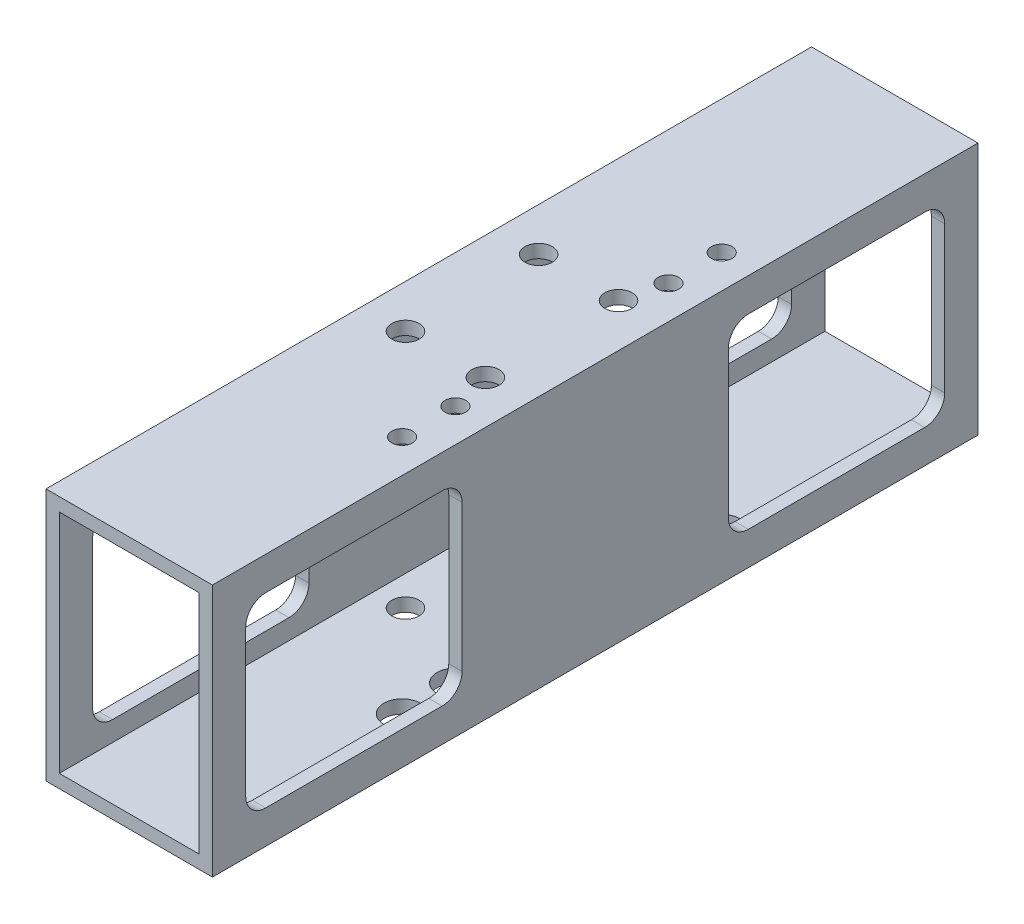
ISO-10303-21;
HEADER;
FILE_DESCRIPTION(('STEP AP214'),'2;1');
FILE_NAME('part.step','',(''),(''),'','','');
FILE_SCHEMA(('AUTOMOTIVE_DESIGN { 1 0 10303 214 1 1 1 1 }'));
ENDSEC;
DATA;
#1=APPLICATION_CONTEXT('core data for automotive mechanical design processes');
#2=APPLICATION_PROTOCOL_DEFINITION('international standard','automotive_design',2000,#1);
#3=PRODUCT_CONTEXT('',#1,'mechanical');
#4=PRODUCT('Part','Part','',(#3));
#5=PRODUCT_RELATED_PRODUCT_CATEGORY('part','',(#4));
#6=PRODUCT_DEFINITION_FORMATION('','',#4);
#7=PRODUCT_DEFINITION_CONTEXT('part definition',#1,'design');
#8=PRODUCT_DEFINITION('design','',#6,#7);
#9=PRODUCT_DEFINITION_SHAPE('','',#8);
#10=(LENGTH_UNIT() NAMED_UNIT(*) SI_UNIT(.MILLI.,.METRE.));
#11=(NAMED_UNIT(*) PLANE_ANGLE_UNIT() SI_UNIT($,.RADIAN.));
#12=(NAMED_UNIT(*) SI_UNIT($,.STERADIAN.) SOLID_ANGLE_UNIT());
#13=UNCERTAINTY_MEASURE_WITH_UNIT(LENGTH_MEASURE(1.E-05),#10,'distance_accuracy_value','');
#14=(GEOMETRIC_REPRESENTATION_CONTEXT(3) GLOBAL_UNCERTAINTY_ASSIGNED_CONTEXT((#13)) GLOBAL_UNIT_ASSIGNED_CONTEXT((#10,
#11,#12)) REPRESENTATION_CONTEXT('',''));
#15=CARTESIAN_POINT('',(0.,0.,0.));
#16=DIRECTION('',(0.,0.,1.));
#17=DIRECTION('',(1.,0.,0.));
#18=AXIS2_PLACEMENT_3D('',#15,#16,#17);
#19=CARTESIAN_POINT('',(0.,0.,115.));
#20=DIRECTION('',(0.,0.,-1.));
#21=DIRECTION('',(-1.,0.,0.));
#22=AXIS2_PLACEMENT_3D('',#19,#20,#21);
#23=PLANE('',#22);
#24=DIRECTION('',(0.,1.,0.));
#25=VECTOR('',#24,1.);
#26=CARTESIAN_POINT('',(12.5,-19.,115.));
#27=LINE('',#26,#25);
#28=CARTESIAN_POINT('',(12.5,-19.,115.));
#29=VERTEX_POINT('',#28);
#30=CARTESIAN_POINT('',(12.5,19.,115.));
#31=VERTEX_POINT('',#30);
#32=EDGE_CURVE('E553',#29,#31,#27,.T.);
#33=ORIENTED_EDGE('',*,*,#32,.T.);
#34=DIRECTION('',(-1.,0.,0.));
#35=VECTOR('',#34,1.);
#36=CARTESIAN_POINT('',(-12.5,19.,115.));
#37=LINE('',#36,#35);
#38=CARTESIAN_POINT('',(-12.5,19.,115.));
#39=VERTEX_POINT('',#38);
#40=EDGE_CURVE('E556',#31,#39,#37,.T.);
#41=ORIENTED_EDGE('',*,*,#40,.T.);
#42=DIRECTION('',(0.,-1.,0.));
#43=VECTOR('',#42,1.);
#44=CARTESIAN_POINT('',(-12.5,-19.,115.));
#45=LINE('',#44,#43);
#46=CARTESIAN_POINT('',(-12.5,-19.,115.));
#47=VERTEX_POINT('',#46);
#48=EDGE_CURVE('E559',#39,#47,#45,.T.);
#49=ORIENTED_EDGE('',*,*,#48,.T.);
#50=DIRECTION('',(1.,0.,0.));
#51=VECTOR('',#50,1.);
#52=CARTESIAN_POINT('',(-12.5,-19.,115.));
#53=LINE('',#52,#51);
#54=EDGE_CURVE('E561',#47,#29,#53,.T.);
#55=ORIENTED_EDGE('',*,*,#54,.T.);
#56=EDGE_LOOP('',(#33,#41,#49,#55));
#57=FACE_BOUND('',#56,.T.);
#58=DIRECTION('',(0.,-1.,0.));
#59=VECTOR('',#58,1.);
#60=CARTESIAN_POINT('',(-10.5,-17.,115.));
#61=LINE('',#60,#59);
#62=CARTESIAN_POINT('',(-10.5,17.,115.));
#63=VERTEX_POINT('',#62);
#64=CARTESIAN_POINT('',(-10.5,-17.,115.));
#65=VERTEX_POINT('',#64);
#66=EDGE_CURVE('E522',#63,#65,#61,.T.);
#67=ORIENTED_EDGE('',*,*,#66,.F.);
#68=DIRECTION('',(-1.,0.,0.));
#69=VECTOR('',#68,1.);
#70=CARTESIAN_POINT('',(-10.5,17.,115.));
#71=LINE('',#70,#69);
#72=CARTESIAN_POINT('',(10.5,17.,115.));
#73=VERTEX_POINT('',#72);
#74=EDGE_CURVE('E530',#73,#63,#71,.T.);
#75=ORIENTED_EDGE('',*,*,#74,.F.);
#76=DIRECTION('',(0.,1.,0.));
#77=VECTOR('',#76,1.);
#78=CARTESIAN_POINT('',(10.5,-17.,115.));
#79=LINE('',#78,#77);
#80=CARTESIAN_POINT('',(10.5,-17.,115.));
#81=VERTEX_POINT('',#80);
#82=EDGE_CURVE('E527',#81,#73,#79,.T.);
#83=ORIENTED_EDGE('',*,*,#82,.F.);
#84=DIRECTION('',(1.,0.,0.));
#85=VECTOR('',#84,1.);
#86=CARTESIAN_POINT('',(-10.5,-17.,115.));
#87=LINE('',#86,#85);
#88=EDGE_CURVE('E524',#65,#81,#87,.T.);
#89=ORIENTED_EDGE('',*,*,#88,.F.);
#90=EDGE_LOOP('',(#67,#75,#83,#89));
#91=FACE_BOUND('',#90,.T.);
#92=ADVANCED_FACE('F34',(#57,#91),#23,.F.);
#93=CARTESIAN_POINT('',(0.,0.,0.));
#94=DIRECTION('',(0.,0.,-1.));
#95=DIRECTION('',(-1.,0.,0.));
#96=AXIS2_PLACEMENT_3D('',#93,#94,#95);
#97=PLANE('',#96);
#98=DIRECTION('',(0.,1.,0.));
#99=VECTOR('',#98,1.);
#100=CARTESIAN_POINT('',(12.5,-19.,0.));
#101=LINE('',#100,#99);
#102=CARTESIAN_POINT('',(12.5,-19.,0.));
#103=VERTEX_POINT('',#102);
#104=CARTESIAN_POINT('',(12.5,19.,0.));
#105=VERTEX_POINT('',#104);
#106=EDGE_CURVE('E552',#103,#105,#101,.T.);
#107=ORIENTED_EDGE('',*,*,#106,.F.);
#108=DIRECTION('',(1.,0.,0.));
#109=VECTOR('',#108,1.);
#110=CARTESIAN_POINT('',(-12.5,-19.,0.));
#111=LINE('',#110,#109);
#112=CARTESIAN_POINT('',(-12.5,-19.,0.));
#113=VERTEX_POINT('',#112);
#114=EDGE_CURVE('E557',#113,#103,#111,.T.);
#115=ORIENTED_EDGE('',*,*,#114,.F.);
#116=DIRECTION('',(0.,-1.,0.));
#117=VECTOR('',#116,1.);
#118=CARTESIAN_POINT('',(-12.5,-19.,0.));
#119=LINE('',#118,#117);
#120=CARTESIAN_POINT('',(-12.5,19.,0.));
#121=VERTEX_POINT('',#120);
#122=EDGE_CURVE('E568',#121,#113,#119,.T.);
#123=ORIENTED_EDGE('',*,*,#122,.F.);
#124=DIRECTION('',(-1.,0.,0.));
#125=VECTOR('',#124,1.);
#126=CARTESIAN_POINT('',(-12.5,19.,0.));
#127=LINE('',#126,#125);
#128=EDGE_CURVE('E566',#105,#121,#127,.T.);
#129=ORIENTED_EDGE('',*,*,#128,.F.);
#130=EDGE_LOOP('',(#107,#115,#123,#129));
#131=FACE_BOUND('',#130,.T.);
#132=DIRECTION('',(-1.,0.,0.));
#133=VECTOR('',#132,1.);
#134=CARTESIAN_POINT('',(-10.5,17.,0.));
#135=LINE('',#134,#133);
#136=CARTESIAN_POINT('',(10.5,17.,0.));
#137=VERTEX_POINT('',#136);
#138=CARTESIAN_POINT('',(-10.5,17.,0.));
#139=VERTEX_POINT('',#138);
#140=EDGE_CURVE('E525',#137,#139,#135,.T.);
#141=ORIENTED_EDGE('',*,*,#140,.T.);
#142=DIRECTION('',(0.,-1.,0.));
#143=VECTOR('',#142,1.);
#144=CARTESIAN_POINT('',(-10.5,-17.,0.));
#145=LINE('',#144,#143);
#146=CARTESIAN_POINT('',(-10.5,-17.,0.));
#147=VERTEX_POINT('',#146);
#148=EDGE_CURVE('E521',#139,#147,#145,.T.);
#149=ORIENTED_EDGE('',*,*,#148,.T.);
#150=DIRECTION('',(1.,0.,0.));
#151=VECTOR('',#150,1.);
#152=CARTESIAN_POINT('',(-10.5,-17.,0.));
#153=LINE('',#152,#151);
#154=CARTESIAN_POINT('',(10.5,-17.,0.));
#155=VERTEX_POINT('',#154);
#156=EDGE_CURVE('E535',#147,#155,#153,.T.);
#157=ORIENTED_EDGE('',*,*,#156,.T.);
#158=DIRECTION('',(0.,1.,0.));
#159=VECTOR('',#158,1.);
#160=CARTESIAN_POINT('',(10.5,-17.,0.));
#161=LINE('',#160,#159);
#162=EDGE_CURVE('E538',#155,#137,#161,.T.);
#163=ORIENTED_EDGE('',*,*,#162,.T.);
#164=EDGE_LOOP('',(#141,#149,#157,#163));
#165=FACE_BOUND('',#164,.T.);
#166=ADVANCED_FACE('F686',(#131,#165),#97,.T.);
#167=CARTESIAN_POINT('',(12.5,-19.,115.));
#168=DIRECTION('',(-1.,0.,0.));
#169=DIRECTION('',(0.,0.,1.));
#170=AXIS2_PLACEMENT_3D('',#167,#168,#169);
#171=PLANE('',#170);
#172=DIRECTION('',(0.,0.,-1.));
#173=VECTOR('',#172,1.);
#174=CARTESIAN_POINT('',(12.5,14.,115.));
#175=LINE('',#174,#173);
#176=CARTESIAN_POINT('',(12.5,14.,107.));
#177=VERTEX_POINT('',#176);
#178=CARTESIAN_POINT('',(12.5,14.,80.5));
#179=VERTEX_POINT('',#178);
#180=EDGE_CURVE('E384',#177,#179,#175,.T.);
#181=ORIENTED_EDGE('',*,*,#180,.T.);
#182=CARTESIAN_POINT('',(12.5,11.,80.5));
#183=DIRECTION('',(-1.,0.,0.));
#184=DIRECTION('',(0.,0.,1.));
#185=AXIS2_PLACEMENT_3D('',#182,#183,#184);
#186=CIRCLE('',#185,3.);
#187=CARTESIAN_POINT('',(12.5,11.,77.5));
#188=VERTEX_POINT('',#187);
#189=EDGE_CURVE('E389',#179,#188,#186,.T.);
#190=ORIENTED_EDGE('',*,*,#189,.T.);
#191=DIRECTION('',(0.,-1.,0.));
#192=VECTOR('',#191,1.);
#193=CARTESIAN_POINT('',(12.5,-19.,77.5));
#194=LINE('',#193,#192);
#195=CARTESIAN_POINT('',(12.5,-11.,77.5));
#196=VERTEX_POINT('',#195);
#197=EDGE_CURVE('E355',#188,#196,#194,.T.);
#198=ORIENTED_EDGE('',*,*,#197,.T.);
#199=CARTESIAN_POINT('',(12.5,-11.,80.5));
#200=DIRECTION('',(-1.,0.,0.));
#201=DIRECTION('',(0.,0.,1.));
#202=AXIS2_PLACEMENT_3D('',#199,#200,#201);
#203=CIRCLE('',#202,3.);
#204=CARTESIAN_POINT('',(12.5,-14.,80.5));
#205=VERTEX_POINT('',#204);
#206=EDGE_CURVE('E359',#196,#205,#203,.T.);
#207=ORIENTED_EDGE('',*,*,#206,.T.);
#208=DIRECTION('',(0.,0.,1.));
#209=VECTOR('',#208,1.);
#210=CARTESIAN_POINT('',(12.5,-14.,115.));
#211=LINE('',#210,#209);
#212=CARTESIAN_POINT('',(12.5,-14.,107.));
#213=VERTEX_POINT('',#212);
#214=EDGE_CURVE('E364',#205,#213,#211,.T.);
#215=ORIENTED_EDGE('',*,*,#214,.T.);
#216=CARTESIAN_POINT('',(12.5,-11.,107.));
#217=DIRECTION('',(-1.,0.,0.));
#218=DIRECTION('',(0.,0.,1.));
#219=AXIS2_PLACEMENT_3D('',#216,#217,#218);
#220=CIRCLE('',#219,2.99999999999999);
#221=CARTESIAN_POINT('',(12.5,-11.,110.));
#222=VERTEX_POINT('',#221);
#223=EDGE_CURVE('E369',#213,#222,#220,.T.);
#224=ORIENTED_EDGE('',*,*,#223,.T.);
#225=DIRECTION('',(0.,1.,0.));
#226=VECTOR('',#225,1.);
#227=CARTESIAN_POINT('',(12.5,-19.,110.));
#228=LINE('',#227,#226);
#229=CARTESIAN_POINT('',(12.5,11.,110.));
#230=VERTEX_POINT('',#229);
#231=EDGE_CURVE('E374',#222,#230,#228,.T.);
#232=ORIENTED_EDGE('',*,*,#231,.T.);
#233=CARTESIAN_POINT('',(12.5,11.,107.));
#234=DIRECTION('',(-1.,0.,0.));
#235=DIRECTION('',(0.,0.,1.));
#236=AXIS2_PLACEMENT_3D('',#233,#234,#235);
#237=CIRCLE('',#236,3.);
#238=EDGE_CURVE('E379',#230,#177,#237,.T.);
#239=ORIENTED_EDGE('',*,*,#238,.T.);
#240=EDGE_LOOP('',(#181,#190,#198,#207,#215,#224,#232,#239));
#241=FACE_BOUND('',#240,.T.);
#242=DIRECTION('',(0.,0.,1.));
#243=VECTOR('',#242,1.);
#244=CARTESIAN_POINT('',(12.5,-14.,115.));
#245=LINE('',#244,#243);
#246=CARTESIAN_POINT('',(12.5,-14.,8.00000000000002));
#247=VERTEX_POINT('',#246);
#248=CARTESIAN_POINT('',(12.5,-14.,34.5));
#249=VERTEX_POINT('',#248);
#250=EDGE_CURVE('E473',#247,#249,#245,.T.);
#251=ORIENTED_EDGE('',*,*,#250,.T.);
#252=CARTESIAN_POINT('',(12.5,-11.,34.5));
#253=DIRECTION('',(-1.,0.,0.));
#254=DIRECTION('',(0.,0.,1.));
#255=AXIS2_PLACEMENT_3D('',#252,#253,#254);
#256=CIRCLE('',#255,3.);
#257=CARTESIAN_POINT('',(12.5,-11.,37.5));
#258=VERTEX_POINT('',#257);
#259=EDGE_CURVE('E478',#249,#258,#256,.T.);
#260=ORIENTED_EDGE('',*,*,#259,.T.);
#261=DIRECTION('',(0.,1.,0.));
#262=VECTOR('',#261,1.);
#263=CARTESIAN_POINT('',(12.5,-19.,37.5));
#264=LINE('',#263,#262);
#265=CARTESIAN_POINT('',(12.5,11.,37.5));
#266=VERTEX_POINT('',#265);
#267=EDGE_CURVE('E442',#258,#266,#264,.T.);
#268=ORIENTED_EDGE('',*,*,#267,.T.);
#269=CARTESIAN_POINT('',(12.5,11.,34.5));
#270=DIRECTION('',(-1.,0.,0.));
#271=DIRECTION('',(0.,0.,1.));
#272=AXIS2_PLACEMENT_3D('',#269,#270,#271);
#273=CIRCLE('',#272,3.);
#274=CARTESIAN_POINT('',(12.5,14.,34.5));
#275=VERTEX_POINT('',#274);
#276=EDGE_CURVE('E448',#266,#275,#273,.T.);
#277=ORIENTED_EDGE('',*,*,#276,.T.);
#278=DIRECTION('',(0.,0.,-1.));
#279=VECTOR('',#278,1.);
#280=CARTESIAN_POINT('',(12.5,14.,115.));
#281=LINE('',#280,#279);
#282=CARTESIAN_POINT('',(12.5,14.,8.00000000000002));
#283=VERTEX_POINT('',#282);
#284=EDGE_CURVE('E453',#275,#283,#281,.T.);
#285=ORIENTED_EDGE('',*,*,#284,.T.);
#286=CARTESIAN_POINT('',(12.5,11.,8.));
#287=DIRECTION('',(-1.,0.,0.));
#288=DIRECTION('',(0.,0.,1.));
#289=AXIS2_PLACEMENT_3D('',#286,#287,#288);
#290=CIRCLE('',#289,3.);
#291=CARTESIAN_POINT('',(12.5,11.,5.));
#292=VERTEX_POINT('',#291);
#293=EDGE_CURVE('E458',#283,#292,#290,.T.);
#294=ORIENTED_EDGE('',*,*,#293,.T.);
#295=DIRECTION('',(0.,-1.,0.));
#296=VECTOR('',#295,1.);
#297=CARTESIAN_POINT('',(12.5,-19.,5.));
#298=LINE('',#297,#296);
#299=CARTESIAN_POINT('',(12.5,-11.,5.));
#300=VERTEX_POINT('',#299);
#301=EDGE_CURVE('E463',#292,#300,#298,.T.);
#302=ORIENTED_EDGE('',*,*,#301,.T.);
#303=CARTESIAN_POINT('',(12.5,-11.,8.));
#304=DIRECTION('',(-1.,0.,0.));
#305=DIRECTION('',(0.,0.,1.));
#306=AXIS2_PLACEMENT_3D('',#303,#304,#305);
#307=CIRCLE('',#306,3.);
#308=EDGE_CURVE('E468',#300,#247,#307,.T.);
#309=ORIENTED_EDGE('',*,*,#308,.T.);
#310=EDGE_LOOP('',(#251,#260,#268,#277,#285,#294,#302,#309));
#311=FACE_BOUND('',#310,.T.);
#312=ORIENTED_EDGE('',*,*,#106,.T.);
#313=DIRECTION('',(0.,0.,-1.));
#314=VECTOR('',#313,1.);
#315=CARTESIAN_POINT('',(12.5,19.,115.));
#316=LINE('',#315,#314);
#317=EDGE_CURVE('E579',#31,#105,#316,.T.);
#318=ORIENTED_EDGE('',*,*,#317,.F.);
#319=ORIENTED_EDGE('',*,*,#32,.F.);
#320=DIRECTION('',(0.,0.,-1.));
#321=VECTOR('',#320,1.);
#322=CARTESIAN_POINT('',(12.5,-19.,115.));
#323=LINE('',#322,#321);
#324=EDGE_CURVE('E563',#29,#103,#323,.T.);
#325=ORIENTED_EDGE('',*,*,#324,.T.);
#326=EDGE_LOOP('',(#312,#318,#319,#325));
#327=FACE_BOUND('',#326,.T.);
#328=ADVANCED_FACE('F36',(#241,#311,#327),#171,.F.);
#329=CARTESIAN_POINT('',(-12.5,19.,115.));
#330=DIRECTION('',(0.,-1.,0.));
#331=DIRECTION('',(0.,0.,-1.));
#332=AXIS2_PLACEMENT_3D('',#329,#330,#331);
#333=PLANE('',#332);
#334=CARTESIAN_POINT('',(7.50000000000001,19.,81.5));
#335=DIRECTION('',(0.,-1.,0.));
#336=DIRECTION('',(0.,0.,-1.));
#337=AXIS2_PLACEMENT_3D('',#334,#335,#336);
#338=CIRCLE('',#337,1.55);
#339=CARTESIAN_POINT('',(7.50000000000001,19.,79.95));
#340=VERTEX_POINT('',#339);
#341=EDGE_CURVE('E624',#340,#340,#338,.T.);
#342=ORIENTED_EDGE('',*,*,#341,.T.);
#343=EDGE_LOOP('',(#342));
#344=FACE_BOUND('',#343,.T.);
#345=CARTESIAN_POINT('',(7.50000000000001,19.,33.5));
#346=DIRECTION('',(0.,-1.,0.));
#347=DIRECTION('',(0.,0.,-1.));
#348=AXIS2_PLACEMENT_3D('',#345,#346,#347);
#349=CIRCLE('',#348,1.55);
#350=CARTESIAN_POINT('',(7.50000000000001,19.,31.95));
#351=VERTEX_POINT('',#350);
#352=EDGE_CURVE('E633',#351,#351,#349,.T.);
#353=ORIENTED_EDGE('',*,*,#352,.T.);
#354=EDGE_LOOP('',(#353));
#355=FACE_BOUND('',#354,.T.);
#356=CARTESIAN_POINT('',(7.5,19.,41.5));
#357=DIRECTION('',(0.,-1.,0.));
#358=DIRECTION('',(0.,0.,-1.));
#359=AXIS2_PLACEMENT_3D('',#356,#357,#358);
#360=CIRCLE('',#359,1.55);
#361=CARTESIAN_POINT('',(7.5,19.,39.95));
#362=VERTEX_POINT('',#361);
#363=EDGE_CURVE('E628',#362,#362,#360,.T.);
#364=ORIENTED_EDGE('',*,*,#363,.T.);
#365=EDGE_LOOP('',(#364));
#366=FACE_BOUND('',#365,.T.);
#367=CARTESIAN_POINT('',(7.5,19.,73.5));
#368=DIRECTION('',(0.,-1.,0.));
#369=DIRECTION('',(0.,0.,-1.));
#370=AXIS2_PLACEMENT_3D('',#367,#368,#369);
#371=CIRCLE('',#370,1.55);
#372=CARTESIAN_POINT('',(7.5,19.,71.95));
#373=VERTEX_POINT('',#372);
#374=EDGE_CURVE('E623',#373,#373,#371,.T.);
#375=ORIENTED_EDGE('',*,*,#374,.T.);
#376=EDGE_LOOP('',(#375));
#377=FACE_BOUND('',#376,.T.);
#378=CARTESIAN_POINT('',(6.00000000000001,19.,47.5));
#379=DIRECTION('',(0.,1.,0.));
#380=DIRECTION('',(0.,0.,1.));
#381=AXIS2_PLACEMENT_3D('',#378,#379,#380);
#382=CIRCLE('',#381,2.05000000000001);
#383=CARTESIAN_POINT('',(6.00000000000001,19.,49.55));
#384=VERTEX_POINT('',#383);
#385=EDGE_CURVE('E482',#384,#384,#382,.T.);
#386=ORIENTED_EDGE('',*,*,#385,.F.);
#387=EDGE_LOOP('',(#386));
#388=FACE_BOUND('',#387,.T.);
#389=CARTESIAN_POINT('',(6.00000000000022,19.,67.5));
#390=DIRECTION('',(0.,1.,0.));
#391=DIRECTION('',(0.,0.,1.));
#392=AXIS2_PLACEMENT_3D('',#389,#390,#391);
#393=CIRCLE('',#392,2.05);
#394=CARTESIAN_POINT('',(6.00000000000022,19.,69.55));
#395=VERTEX_POINT('',#394);
#396=EDGE_CURVE('E486',#395,#395,#393,.T.);
#397=ORIENTED_EDGE('',*,*,#396,.F.);
#398=EDGE_LOOP('',(#397));
#399=FACE_BOUND('',#398,.T.);
#400=CARTESIAN_POINT('',(-5.99999999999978,19.,67.5));
#401=DIRECTION('',(0.,1.,0.));
#402=DIRECTION('',(0.,0.,1.));
#403=AXIS2_PLACEMENT_3D('',#400,#401,#402);
#404=CIRCLE('',#403,2.05);
#405=CARTESIAN_POINT('',(-5.99999999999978,19.,69.55));
#406=VERTEX_POINT('',#405);
#407=EDGE_CURVE('E481',#406,#406,#404,.T.);
#408=ORIENTED_EDGE('',*,*,#407,.F.);
#409=EDGE_LOOP('',(#408));
#410=FACE_BOUND('',#409,.T.);
#411=CARTESIAN_POINT('',(-5.99999999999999,19.,47.5));
#412=DIRECTION('',(0.,1.,0.));
#413=DIRECTION('',(0.,0.,1.));
#414=AXIS2_PLACEMENT_3D('',#411,#412,#413);
#415=CIRCLE('',#414,2.05000000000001);
#416=CARTESIAN_POINT('',(-5.99999999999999,19.,49.55));
#417=VERTEX_POINT('',#416);
#418=EDGE_CURVE('E511',#417,#417,#415,.T.);
#419=ORIENTED_EDGE('',*,*,#418,.F.);
#420=EDGE_LOOP('',(#419));
#421=FACE_BOUND('',#420,.T.);
#422=ORIENTED_EDGE('',*,*,#128,.T.);
#423=DIRECTION('',(0.,0.,-1.));
#424=VECTOR('',#423,1.);
#425=CARTESIAN_POINT('',(-12.5,19.,115.));
#426=LINE('',#425,#424);
#427=EDGE_CURVE('E576',#39,#121,#426,.T.);
#428=ORIENTED_EDGE('',*,*,#427,.F.);
#429=ORIENTED_EDGE('',*,*,#40,.F.);
#430=ORIENTED_EDGE('',*,*,#317,.T.);
#431=EDGE_LOOP('',(#422,#428,#429,#430));
#432=FACE_BOUND('',#431,.T.);
#433=ADVANCED_FACE('F667',(#344,#355,#366,#377,#388,#399,#410,#421,#432),#333,.F.);
#434=CARTESIAN_POINT('',(-12.5,-19.,115.));
#435=DIRECTION('',(1.,0.,0.));
#436=DIRECTION('',(0.,0.,-1.));
#437=AXIS2_PLACEMENT_3D('',#434,#435,#436);
#438=PLANE('',#437);
#439=DIRECTION('',(0.,-1.,0.));
#440=VECTOR('',#439,1.);
#441=CARTESIAN_POINT('',(-12.5,11.,77.5));
#442=LINE('',#441,#440);
#443=CARTESIAN_POINT('',(-12.5,11.,77.5));
#444=VERTEX_POINT('',#443);
#445=CARTESIAN_POINT('',(-12.5,-11.,77.5));
#446=VERTEX_POINT('',#445);
#447=EDGE_CURVE('E308',#444,#446,#442,.T.);
#448=ORIENTED_EDGE('',*,*,#447,.F.);
#449=CARTESIAN_POINT('',(-12.5,11.,80.5));
#450=DIRECTION('',(-1.,0.,0.));
#451=DIRECTION('',(0.,0.,1.));
#452=AXIS2_PLACEMENT_3D('',#449,#450,#451);
#453=CIRCLE('',#452,3.);
#454=CARTESIAN_POINT('',(-12.5,14.,80.5));
#455=VERTEX_POINT('',#454);
#456=EDGE_CURVE('E59',#455,#444,#453,.T.);
#457=ORIENTED_EDGE('',*,*,#456,.F.);
#458=DIRECTION('',(0.,0.,-1.));
#459=VECTOR('',#458,1.);
#460=CARTESIAN_POINT('',(-12.5,14.,107.));
#461=LINE('',#460,#459);
#462=CARTESIAN_POINT('',(-12.5,14.,107.));
#463=VERTEX_POINT('',#462);
#464=EDGE_CURVE('E331',#463,#455,#461,.T.);
#465=ORIENTED_EDGE('',*,*,#464,.F.);
#466=CARTESIAN_POINT('',(-12.5,11.,107.));
#467=DIRECTION('',(-1.,0.,0.));
#468=DIRECTION('',(0.,0.,-1.));
#469=AXIS2_PLACEMENT_3D('',#466,#467,#468);
#470=CIRCLE('',#469,3.);
#471=CARTESIAN_POINT('',(-12.5,11.,110.));
#472=VERTEX_POINT('',#471);
#473=EDGE_CURVE('E328',#472,#463,#470,.T.);
#474=ORIENTED_EDGE('',*,*,#473,.F.);
#475=DIRECTION('',(0.,1.,0.));
#476=VECTOR('',#475,1.);
#477=CARTESIAN_POINT('',(-12.5,11.,110.));
#478=LINE('',#477,#476);
#479=CARTESIAN_POINT('',(-12.5,-11.,110.));
#480=VERTEX_POINT('',#479);
#481=EDGE_CURVE('E325',#480,#472,#478,.T.);
#482=ORIENTED_EDGE('',*,*,#481,.F.);
#483=CARTESIAN_POINT('',(-12.5,-11.,107.));
#484=DIRECTION('',(-1.,0.,0.));
#485=DIRECTION('',(0.,0.,-1.));
#486=AXIS2_PLACEMENT_3D('',#483,#484,#485);
#487=CIRCLE('',#486,2.99999999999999);
#488=CARTESIAN_POINT('',(-12.5,-14.,107.));
#489=VERTEX_POINT('',#488);
#490=EDGE_CURVE('E319',#489,#480,#487,.T.);
#491=ORIENTED_EDGE('',*,*,#490,.F.);
#492=DIRECTION('',(0.,0.,1.));
#493=VECTOR('',#492,1.);
#494=CARTESIAN_POINT('',(-12.5,-14.,107.));
#495=LINE('',#494,#493);
#496=CARTESIAN_POINT('',(-12.5,-14.,80.5));
#497=VERTEX_POINT('',#496);
#498=EDGE_CURVE('E317',#497,#489,#495,.T.);
#499=ORIENTED_EDGE('',*,*,#498,.F.);
#500=CARTESIAN_POINT('',(-12.5,-11.,80.5));
#501=DIRECTION('',(-1.,0.,0.));
#502=DIRECTION('',(0.,0.,-1.));
#503=AXIS2_PLACEMENT_3D('',#500,#501,#502);
#504=CIRCLE('',#503,3.);
#505=EDGE_CURVE('E299',#446,#497,#504,.T.);
#506=ORIENTED_EDGE('',*,*,#505,.F.);
#507=EDGE_LOOP('',(#448,#457,#465,#474,#482,#491,#499,#506));
#508=FACE_BOUND('',#507,.T.);
#509=DIRECTION('',(0.,1.,0.));
#510=VECTOR('',#509,1.);
#511=CARTESIAN_POINT('',(-12.5,11.,37.5));
#512=LINE('',#511,#510);
#513=CARTESIAN_POINT('',(-12.5,-11.,37.5));
#514=VERTEX_POINT('',#513);
#515=CARTESIAN_POINT('',(-12.5,11.,37.5));
#516=VERTEX_POINT('',#515);
#517=EDGE_CURVE('E394',#514,#516,#512,.T.);
#518=ORIENTED_EDGE('',*,*,#517,.F.);
#519=CARTESIAN_POINT('',(-12.5,-11.,34.5));
#520=DIRECTION('',(-1.,0.,0.));
#521=DIRECTION('',(0.,0.,1.));
#522=AXIS2_PLACEMENT_3D('',#519,#520,#521);
#523=CIRCLE('',#522,3.);
#524=CARTESIAN_POINT('',(-12.5,-14.,34.5));
#525=VERTEX_POINT('',#524);
#526=EDGE_CURVE('E392',#525,#514,#523,.T.);
#527=ORIENTED_EDGE('',*,*,#526,.F.);
#528=DIRECTION('',(0.,0.,1.));
#529=VECTOR('',#528,1.);
#530=CARTESIAN_POINT('',(-12.5,-14.,8.00000000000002));
#531=LINE('',#530,#529);
#532=CARTESIAN_POINT('',(-12.5,-14.,8.00000000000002));
#533=VERTEX_POINT('',#532);
#534=EDGE_CURVE('E412',#533,#525,#531,.T.);
#535=ORIENTED_EDGE('',*,*,#534,.F.);
#536=CARTESIAN_POINT('',(-12.5,-11.,8.));
#537=DIRECTION('',(-1.,0.,0.));
#538=DIRECTION('',(0.,0.,1.));
#539=AXIS2_PLACEMENT_3D('',#536,#537,#538);
#540=CIRCLE('',#539,3.);
#541=CARTESIAN_POINT('',(-12.5,-11.,5.));
#542=VERTEX_POINT('',#541);
#543=EDGE_CURVE('E409',#542,#533,#540,.T.);
#544=ORIENTED_EDGE('',*,*,#543,.F.);
#545=DIRECTION('',(0.,-1.,0.));
#546=VECTOR('',#545,1.);
#547=CARTESIAN_POINT('',(-12.5,11.,5.));
#548=LINE('',#547,#546);
#549=CARTESIAN_POINT('',(-12.5,11.,5.));
#550=VERTEX_POINT('',#549);
#551=EDGE_CURVE('E406',#550,#542,#548,.T.);
#552=ORIENTED_EDGE('',*,*,#551,.F.);
#553=CARTESIAN_POINT('',(-12.5,11.,8.));
#554=DIRECTION('',(-1.,0.,0.));
#555=DIRECTION('',(0.,0.,1.));
#556=AXIS2_PLACEMENT_3D('',#553,#554,#555);
#557=CIRCLE('',#556,3.);
#558=CARTESIAN_POINT('',(-12.5,14.,8.00000000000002));
#559=VERTEX_POINT('',#558);
#560=EDGE_CURVE('E403',#559,#550,#557,.T.);
#561=ORIENTED_EDGE('',*,*,#560,.F.);
#562=DIRECTION('',(0.,0.,-1.));
#563=VECTOR('',#562,1.);
#564=CARTESIAN_POINT('',(-12.5,14.,8.00000000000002));
#565=LINE('',#564,#563);
#566=CARTESIAN_POINT('',(-12.5,14.,34.5));
#567=VERTEX_POINT('',#566);
#568=EDGE_CURVE('E400',#567,#559,#565,.T.);
#569=ORIENTED_EDGE('',*,*,#568,.F.);
#570=CARTESIAN_POINT('',(-12.5,11.,34.5));
#571=DIRECTION('',(-1.,0.,0.));
#572=DIRECTION('',(0.,0.,-1.));
#573=AXIS2_PLACEMENT_3D('',#570,#571,#572);
#574=CIRCLE('',#573,3.);
#575=EDGE_CURVE('E397',#516,#567,#574,.T.);
#576=ORIENTED_EDGE('',*,*,#575,.F.);
#577=EDGE_LOOP('',(#518,#527,#535,#544,#552,#561,#569,#576));
#578=FACE_BOUND('',#577,.T.);
#579=ORIENTED_EDGE('',*,*,#122,.T.);
#580=DIRECTION('',(0.,0.,-1.));
#581=VECTOR('',#580,1.);
#582=CARTESIAN_POINT('',(-12.5,-19.,115.));
#583=LINE('',#582,#581);
#584=EDGE_CURVE('E573',#47,#113,#583,.T.);
#585=ORIENTED_EDGE('',*,*,#584,.F.);
#586=ORIENTED_EDGE('',*,*,#48,.F.);
#587=ORIENTED_EDGE('',*,*,#427,.T.);
#588=EDGE_LOOP('',(#579,#585,#586,#587));
#589=FACE_BOUND('',#588,.T.);
#590=ADVANCED_FACE('F313',(#508,#578,#589),#438,.F.);
#591=CARTESIAN_POINT('',(-12.5,-19.,115.));
#592=DIRECTION('',(0.,1.,0.));
#593=DIRECTION('',(0.,0.,1.));
#594=AXIS2_PLACEMENT_3D('',#591,#592,#593);
#595=PLANE('',#594);
#596=CARTESIAN_POINT('',(7.5,-19.,73.5));
#597=DIRECTION('',(0.,-1.,0.));
#598=DIRECTION('',(0.,0.,-1.));
#599=AXIS2_PLACEMENT_3D('',#596,#597,#598);
#600=CIRCLE('',#599,2.75);
#601=CARTESIAN_POINT('',(7.5,-19.,70.75));
#602=VERTEX_POINT('',#601);
#603=EDGE_CURVE('E643',#602,#602,#600,.T.);
#604=ORIENTED_EDGE('',*,*,#603,.F.);
#605=EDGE_LOOP('',(#604));
#606=FACE_BOUND('',#605,.T.);
#607=CARTESIAN_POINT('',(7.5,-19.,41.5));
#608=DIRECTION('',(0.,-1.,0.));
#609=DIRECTION('',(0.,0.,-1.));
#610=AXIS2_PLACEMENT_3D('',#607,#608,#609);
#611=CIRCLE('',#610,2.75);
#612=CARTESIAN_POINT('',(7.5,-19.,38.75));
#613=VERTEX_POINT('',#612);
#614=EDGE_CURVE('E745',#613,#613,#611,.T.);
#615=ORIENTED_EDGE('',*,*,#614,.F.);
#616=EDGE_LOOP('',(#615));
#617=FACE_BOUND('',#616,.T.);
#618=CARTESIAN_POINT('',(7.50000000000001,-19.,33.5));
#619=DIRECTION('',(0.,-1.,0.));
#620=DIRECTION('',(0.,0.,-1.));
#621=AXIS2_PLACEMENT_3D('',#618,#619,#620);
#622=CIRCLE('',#621,2.75);
#623=CARTESIAN_POINT('',(7.50000000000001,-19.,30.75));
#624=VERTEX_POINT('',#623);
#625=EDGE_CURVE('E656',#624,#624,#622,.T.);
#626=ORIENTED_EDGE('',*,*,#625,.F.);
#627=EDGE_LOOP('',(#626));
#628=FACE_BOUND('',#627,.T.);
#629=CARTESIAN_POINT('',(7.50000000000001,-19.,81.5));
#630=DIRECTION('',(0.,-1.,0.));
#631=DIRECTION('',(0.,0.,-1.));
#632=AXIS2_PLACEMENT_3D('',#629,#630,#631);
#633=CIRCLE('',#632,2.75);
#634=CARTESIAN_POINT('',(7.50000000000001,-19.,78.75));
#635=VERTEX_POINT('',#634);
#636=EDGE_CURVE('E639',#635,#635,#633,.T.);
#637=ORIENTED_EDGE('',*,*,#636,.F.);
#638=EDGE_LOOP('',(#637));
#639=FACE_BOUND('',#638,.T.);
#640=CARTESIAN_POINT('',(6.00000000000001,-19.,47.5));
#641=DIRECTION('',(0.,1.,0.));
#642=DIRECTION('',(0.,0.,1.));
#643=AXIS2_PLACEMENT_3D('',#640,#641,#642);
#644=CIRCLE('',#643,2.05000000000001);
#645=CARTESIAN_POINT('',(6.00000000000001,-19.,49.55));
#646=VERTEX_POINT('',#645);
#647=EDGE_CURVE('E508',#646,#646,#644,.T.);
#648=ORIENTED_EDGE('',*,*,#647,.T.);
#649=EDGE_LOOP('',(#648));
#650=FACE_BOUND('',#649,.T.);
#651=CARTESIAN_POINT('',(6.00000000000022,-19.,67.5));
#652=DIRECTION('',(0.,1.,0.));
#653=DIRECTION('',(0.,0.,1.));
#654=AXIS2_PLACEMENT_3D('',#651,#652,#653);
#655=CIRCLE('',#654,2.05);
#656=CARTESIAN_POINT('',(6.00000000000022,-19.,69.55));
#657=VERTEX_POINT('',#656);
#658=EDGE_CURVE('E501',#657,#657,#655,.T.);
#659=ORIENTED_EDGE('',*,*,#658,.T.);
#660=EDGE_LOOP('',(#659));
#661=FACE_BOUND('',#660,.T.);
#662=CARTESIAN_POINT('',(-5.99999999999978,-19.,67.5));
#663=DIRECTION('',(0.,1.,0.));
#664=DIRECTION('',(0.,0.,1.));
#665=AXIS2_PLACEMENT_3D('',#662,#663,#664);
#666=CIRCLE('',#665,2.05);
#667=CARTESIAN_POINT('',(-5.99999999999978,-19.,69.55));
#668=VERTEX_POINT('',#667);
#669=EDGE_CURVE('E494',#668,#668,#666,.T.);
#670=ORIENTED_EDGE('',*,*,#669,.T.);
#671=EDGE_LOOP('',(#670));
#672=FACE_BOUND('',#671,.T.);
#673=CARTESIAN_POINT('',(-5.99999999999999,-19.,47.5));
#674=DIRECTION('',(0.,1.,0.));
#675=DIRECTION('',(0.,0.,1.));
#676=AXIS2_PLACEMENT_3D('',#673,#674,#675);
#677=CIRCLE('',#676,2.05000000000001);
#678=CARTESIAN_POINT('',(-5.99999999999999,-19.,49.55));
#679=VERTEX_POINT('',#678);
#680=EDGE_CURVE('E518',#679,#679,#677,.T.);
#681=ORIENTED_EDGE('',*,*,#680,.T.);
#682=EDGE_LOOP('',(#681));
#683=FACE_BOUND('',#682,.T.);
#684=ORIENTED_EDGE('',*,*,#114,.T.);
#685=ORIENTED_EDGE('',*,*,#324,.F.);
#686=ORIENTED_EDGE('',*,*,#54,.F.);
#687=ORIENTED_EDGE('',*,*,#584,.T.);
#688=EDGE_LOOP('',(#684,#685,#686,#687));
#689=FACE_BOUND('',#688,.T.);
#690=ADVANCED_FACE('F699',(#606,#617,#628,#639,#650,#661,#672,#683,#689),#595,.F.);
#691=CARTESIAN_POINT('',(-10.5,-17.,115.));
#692=DIRECTION('',(1.,0.,0.));
#693=DIRECTION('',(0.,0.,-1.));
#694=AXIS2_PLACEMENT_3D('',#691,#692,#693);
#695=PLANE('',#694);
#696=CARTESIAN_POINT('',(-10.5,11.,80.5));
#697=DIRECTION('',(1.,0.,0.));
#698=DIRECTION('',(0.,0.,-1.));
#699=AXIS2_PLACEMENT_3D('',#696,#697,#698);
#700=CIRCLE('',#699,3.);
#701=CARTESIAN_POINT('',(-10.5,11.,77.5));
#702=VERTEX_POINT('',#701);
#703=CARTESIAN_POINT('',(-10.5,14.,80.5));
#704=VERTEX_POINT('',#703);
#705=EDGE_CURVE('E387',#702,#704,#700,.T.);
#706=ORIENTED_EDGE('',*,*,#705,.F.);
#707=DIRECTION('',(0.,1.,0.));
#708=VECTOR('',#707,1.);
#709=CARTESIAN_POINT('',(-10.5,-17.,77.5));
#710=LINE('',#709,#708);
#711=CARTESIAN_POINT('',(-10.5,-11.,77.5));
#712=VERTEX_POINT('',#711);
#713=EDGE_CURVE('E353',#712,#702,#710,.T.);
#714=ORIENTED_EDGE('',*,*,#713,.F.);
#715=CARTESIAN_POINT('',(-10.5,-11.,80.5));
#716=DIRECTION('',(1.,0.,0.));
#717=DIRECTION('',(0.,0.,-1.));
#718=AXIS2_PLACEMENT_3D('',#715,#716,#717);
#719=CIRCLE('',#718,3.);
#720=CARTESIAN_POINT('',(-10.5,-14.,80.5));
#721=VERTEX_POINT('',#720);
#722=EDGE_CURVE('E302',#721,#712,#719,.T.);
#723=ORIENTED_EDGE('',*,*,#722,.F.);
#724=DIRECTION('',(0.,0.,-1.));
#725=VECTOR('',#724,1.);
#726=CARTESIAN_POINT('',(-10.5,-14.,115.));
#727=LINE('',#726,#725);
#728=CARTESIAN_POINT('',(-10.5,-14.,107.));
#729=VERTEX_POINT('',#728);
#730=EDGE_CURVE('E362',#729,#721,#727,.T.);
#731=ORIENTED_EDGE('',*,*,#730,.F.);
#732=CARTESIAN_POINT('',(-10.5,-11.,107.));
#733=DIRECTION('',(1.,0.,0.));
#734=DIRECTION('',(0.,0.,-1.));
#735=AXIS2_PLACEMENT_3D('',#732,#733,#734);
#736=CIRCLE('',#735,2.99999999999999);
#737=CARTESIAN_POINT('',(-10.5,-11.,110.));
#738=VERTEX_POINT('',#737);
#739=EDGE_CURVE('E367',#738,#729,#736,.T.);
#740=ORIENTED_EDGE('',*,*,#739,.F.);
#741=DIRECTION('',(0.,-1.,0.));
#742=VECTOR('',#741,1.);
#743=CARTESIAN_POINT('',(-10.5,-17.,110.));
#744=LINE('',#743,#742);
#745=CARTESIAN_POINT('',(-10.5,11.,110.));
#746=VERTEX_POINT('',#745);
#747=EDGE_CURVE('E372',#746,#738,#744,.T.);
#748=ORIENTED_EDGE('',*,*,#747,.F.);
#749=CARTESIAN_POINT('',(-10.5,11.,107.));
#750=DIRECTION('',(1.,0.,0.));
#751=DIRECTION('',(0.,0.,-1.));
#752=AXIS2_PLACEMENT_3D('',#749,#750,#751);
#753=CIRCLE('',#752,3.);
#754=CARTESIAN_POINT('',(-10.5,14.,107.));
#755=VERTEX_POINT('',#754);
#756=EDGE_CURVE('E377',#755,#746,#753,.T.);
#757=ORIENTED_EDGE('',*,*,#756,.F.);
#758=DIRECTION('',(0.,0.,1.));
#759=VECTOR('',#758,1.);
#760=CARTESIAN_POINT('',(-10.5,14.,115.));
#761=LINE('',#760,#759);
#762=EDGE_CURVE('E382',#704,#755,#761,.T.);
#763=ORIENTED_EDGE('',*,*,#762,.F.);
#764=EDGE_LOOP('',(#706,#714,#723,#731,#740,#748,#757,#763));
#765=FACE_BOUND('',#764,.T.);
#766=CARTESIAN_POINT('',(-10.5,-11.,34.5));
#767=DIRECTION('',(1.,0.,0.));
#768=DIRECTION('',(0.,0.,-1.));
#769=AXIS2_PLACEMENT_3D('',#766,#767,#768);
#770=CIRCLE('',#769,3.);
#771=CARTESIAN_POINT('',(-10.5,-11.,37.5));
#772=VERTEX_POINT('',#771);
#773=CARTESIAN_POINT('',(-10.5,-14.,34.5));
#774=VERTEX_POINT('',#773);
#775=EDGE_CURVE('E476',#772,#774,#770,.T.);
#776=ORIENTED_EDGE('',*,*,#775,.F.);
#777=DIRECTION('',(0.,-1.,0.));
#778=VECTOR('',#777,1.);
#779=CARTESIAN_POINT('',(-10.5,-17.,37.5));
#780=LINE('',#779,#778);
#781=CARTESIAN_POINT('',(-10.5,11.,37.5));
#782=VERTEX_POINT('',#781);
#783=EDGE_CURVE('E440',#782,#772,#780,.T.);
#784=ORIENTED_EDGE('',*,*,#783,.F.);
#785=CARTESIAN_POINT('',(-10.5,11.,34.5));
#786=DIRECTION('',(1.,0.,0.));
#787=DIRECTION('',(0.,0.,-1.));
#788=AXIS2_PLACEMENT_3D('',#785,#786,#787);
#789=CIRCLE('',#788,3.);
#790=CARTESIAN_POINT('',(-10.5,14.,34.5));
#791=VERTEX_POINT('',#790);
#792=EDGE_CURVE('E445',#791,#782,#789,.T.);
#793=ORIENTED_EDGE('',*,*,#792,.F.);
#794=DIRECTION('',(0.,0.,1.));
#795=VECTOR('',#794,1.);
#796=CARTESIAN_POINT('',(-10.5,14.,115.));
#797=LINE('',#796,#795);
#798=CARTESIAN_POINT('',(-10.5,14.,8.00000000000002));
#799=VERTEX_POINT('',#798);
#800=EDGE_CURVE('E451',#799,#791,#797,.T.);
#801=ORIENTED_EDGE('',*,*,#800,.F.);
#802=CARTESIAN_POINT('',(-10.5,11.,8.));
#803=DIRECTION('',(1.,0.,0.));
#804=DIRECTION('',(0.,0.,-1.));
#805=AXIS2_PLACEMENT_3D('',#802,#803,#804);
#806=CIRCLE('',#805,3.);
#807=CARTESIAN_POINT('',(-10.5,11.,5.));
#808=VERTEX_POINT('',#807);
#809=EDGE_CURVE('E456',#808,#799,#806,.T.);
#810=ORIENTED_EDGE('',*,*,#809,.F.);
#811=DIRECTION('',(0.,1.,0.));
#812=VECTOR('',#811,1.);
#813=CARTESIAN_POINT('',(-10.5,-17.,5.));
#814=LINE('',#813,#812);
#815=CARTESIAN_POINT('',(-10.5,-11.,5.));
#816=VERTEX_POINT('',#815);
#817=EDGE_CURVE('E461',#816,#808,#814,.T.);
#818=ORIENTED_EDGE('',*,*,#817,.F.);
#819=CARTESIAN_POINT('',(-10.5,-11.,8.));
#820=DIRECTION('',(1.,0.,0.));
#821=DIRECTION('',(0.,0.,-1.));
#822=AXIS2_PLACEMENT_3D('',#819,#820,#821);
#823=CIRCLE('',#822,3.);
#824=CARTESIAN_POINT('',(-10.5,-14.,8.00000000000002));
#825=VERTEX_POINT('',#824);
#826=EDGE_CURVE('E466',#825,#816,#823,.T.);
#827=ORIENTED_EDGE('',*,*,#826,.F.);
#828=DIRECTION('',(0.,0.,-1.));
#829=VECTOR('',#828,1.);
#830=CARTESIAN_POINT('',(-10.5,-14.,115.));
#831=LINE('',#830,#829);
#832=EDGE_CURVE('E471',#774,#825,#831,.T.);
#833=ORIENTED_EDGE('',*,*,#832,.F.);
#834=EDGE_LOOP('',(#776,#784,#793,#801,#810,#818,#827,#833));
#835=FACE_BOUND('',#834,.T.);
#836=ORIENTED_EDGE('',*,*,#148,.F.);
#837=DIRECTION('',(0.,0.,-1.));
#838=VECTOR('',#837,1.);
#839=CARTESIAN_POINT('',(-10.5,17.,115.));
#840=LINE('',#839,#838);
#841=EDGE_CURVE('E532',#63,#139,#840,.T.);
#842=ORIENTED_EDGE('',*,*,#841,.F.);
#843=ORIENTED_EDGE('',*,*,#66,.T.);
#844=DIRECTION('',(0.,0.,-1.));
#845=VECTOR('',#844,1.);
#846=CARTESIAN_POINT('',(-10.5,-17.,115.));
#847=LINE('',#846,#845);
#848=EDGE_CURVE('E549',#65,#147,#847,.T.);
#849=ORIENTED_EDGE('',*,*,#848,.T.);
#850=EDGE_LOOP('',(#836,#842,#843,#849));
#851=FACE_BOUND('',#850,.T.);
#852=ADVANCED_FACE('F696',(#765,#835,#851),#695,.T.);
#853=CARTESIAN_POINT('',(-10.5,-17.,115.));
#854=DIRECTION('',(0.,1.,0.));
#855=DIRECTION('',(0.,0.,1.));
#856=AXIS2_PLACEMENT_3D('',#853,#854,#855);
#857=PLANE('',#856);
#858=CARTESIAN_POINT('',(7.5,-17.,73.5));
#859=DIRECTION('',(0.,1.,0.));
#860=DIRECTION('',(0.,0.,1.));
#861=AXIS2_PLACEMENT_3D('',#858,#859,#860);
#862=CIRCLE('',#861,2.75);
#863=CARTESIAN_POINT('',(7.5,-17.,76.25));
#864=VERTEX_POINT('',#863);
#865=EDGE_CURVE('E38',#864,#864,#862,.T.);
#866=ORIENTED_EDGE('',*,*,#865,.F.);
#867=EDGE_LOOP('',(#866));
#868=FACE_BOUND('',#867,.T.);
#869=CARTESIAN_POINT('',(7.5,-17.,41.5));
#870=DIRECTION('',(0.,1.,0.));
#871=DIRECTION('',(0.,0.,1.));
#872=AXIS2_PLACEMENT_3D('',#869,#870,#871);
#873=CIRCLE('',#872,2.75);
#874=CARTESIAN_POINT('',(7.5,-17.,44.25));
#875=VERTEX_POINT('',#874);
#876=EDGE_CURVE('E642',#875,#875,#873,.T.);
#877=ORIENTED_EDGE('',*,*,#876,.F.);
#878=EDGE_LOOP('',(#877));
#879=FACE_BOUND('',#878,.T.);
#880=CARTESIAN_POINT('',(7.50000000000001,-17.,33.5));
#881=DIRECTION('',(0.,1.,0.));
#882=DIRECTION('',(0.,0.,1.));
#883=AXIS2_PLACEMENT_3D('',#880,#881,#882);
#884=CIRCLE('',#883,2.75);
#885=CARTESIAN_POINT('',(7.50000000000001,-17.,36.25));
#886=VERTEX_POINT('',#885);
#887=EDGE_CURVE('E640',#886,#886,#884,.T.);
#888=ORIENTED_EDGE('',*,*,#887,.F.);
#889=EDGE_LOOP('',(#888));
#890=FACE_BOUND('',#889,.T.);
#891=CARTESIAN_POINT('',(7.50000000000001,-17.,81.5));
#892=DIRECTION('',(0.,1.,0.));
#893=DIRECTION('',(0.,0.,1.));
#894=AXIS2_PLACEMENT_3D('',#891,#892,#893);
#895=CIRCLE('',#894,2.75);
#896=CARTESIAN_POINT('',(7.50000000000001,-17.,84.25));
#897=VERTEX_POINT('',#896);
#898=EDGE_CURVE('E629',#897,#897,#895,.T.);
#899=ORIENTED_EDGE('',*,*,#898,.F.);
#900=EDGE_LOOP('',(#899));
#901=FACE_BOUND('',#900,.T.);
#902=CARTESIAN_POINT('',(6.00000000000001,-17.,47.5));
#903=DIRECTION('',(0.,1.,0.));
#904=DIRECTION('',(0.,0.,1.));
#905=AXIS2_PLACEMENT_3D('',#902,#903,#904);
#906=CIRCLE('',#905,2.05000000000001);
#907=CARTESIAN_POINT('',(6.00000000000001,-17.,49.55));
#908=VERTEX_POINT('',#907);
#909=EDGE_CURVE('E505',#908,#908,#906,.T.);
#910=ORIENTED_EDGE('',*,*,#909,.F.);
#911=EDGE_LOOP('',(#910));
#912=FACE_BOUND('',#911,.T.);
#913=CARTESIAN_POINT('',(6.00000000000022,-17.,67.5));
#914=DIRECTION('',(0.,1.,0.));
#915=DIRECTION('',(0.,0.,1.));
#916=AXIS2_PLACEMENT_3D('',#913,#914,#915);
#917=CIRCLE('',#916,2.05);
#918=CARTESIAN_POINT('',(6.00000000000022,-17.,69.55));
#919=VERTEX_POINT('',#918);
#920=EDGE_CURVE('E498',#919,#919,#917,.T.);
#921=ORIENTED_EDGE('',*,*,#920,.F.);
#922=EDGE_LOOP('',(#921));
#923=FACE_BOUND('',#922,.T.);
#924=CARTESIAN_POINT('',(-5.99999999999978,-17.,67.5));
#925=DIRECTION('',(0.,1.,0.));
#926=DIRECTION('',(0.,0.,1.));
#927=AXIS2_PLACEMENT_3D('',#924,#925,#926);
#928=CIRCLE('',#927,2.05);
#929=CARTESIAN_POINT('',(-5.99999999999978,-17.,69.55));
#930=VERTEX_POINT('',#929);
#931=EDGE_CURVE('E491',#930,#930,#928,.T.);
#932=ORIENTED_EDGE('',*,*,#931,.F.);
#933=EDGE_LOOP('',(#932));
#934=FACE_BOUND('',#933,.T.);
#935=CARTESIAN_POINT('',(-5.99999999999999,-17.,47.5));
#936=DIRECTION('',(0.,1.,0.));
#937=DIRECTION('',(0.,0.,1.));
#938=AXIS2_PLACEMENT_3D('',#935,#936,#937);
#939=CIRCLE('',#938,2.05000000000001);
#940=CARTESIAN_POINT('',(-5.99999999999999,-17.,49.55));
#941=VERTEX_POINT('',#940);
#942=EDGE_CURVE('E515',#941,#941,#939,.T.);
#943=ORIENTED_EDGE('',*,*,#942,.F.);
#944=EDGE_LOOP('',(#943));
#945=FACE_BOUND('',#944,.T.);
#946=ORIENTED_EDGE('',*,*,#156,.F.);
#947=ORIENTED_EDGE('',*,*,#848,.F.);
#948=ORIENTED_EDGE('',*,*,#88,.T.);
#949=DIRECTION('',(0.,0.,-1.));
#950=VECTOR('',#949,1.);
#951=CARTESIAN_POINT('',(10.5,-17.,115.));
#952=LINE('',#951,#950);
#953=EDGE_CURVE('E547',#81,#155,#952,.T.);
#954=ORIENTED_EDGE('',*,*,#953,.T.);
#955=EDGE_LOOP('',(#946,#947,#948,#954));
#956=FACE_BOUND('',#955,.T.);
#957=ADVANCED_FACE('F791',(#868,#879,#890,#901,#912,#923,#934,#945,#956),#857,.T.);
#958=CARTESIAN_POINT('',(10.5,-17.,115.));
#959=DIRECTION('',(-1.,0.,0.));
#960=DIRECTION('',(0.,-1.,0.));
#961=AXIS2_PLACEMENT_3D('',#958,#959,#960);
#962=PLANE('',#961);
#963=CARTESIAN_POINT('',(10.5,11.,80.5));
#964=DIRECTION('',(-1.,0.,0.));
#965=DIRECTION('',(0.,-1.,0.));
#966=AXIS2_PLACEMENT_3D('',#963,#964,#965);
#967=CIRCLE('',#966,3.);
#968=CARTESIAN_POINT('',(10.5,14.,80.5));
#969=VERTEX_POINT('',#968);
#970=CARTESIAN_POINT('',(10.5,11.,77.5));
#971=VERTEX_POINT('',#970);
#972=EDGE_CURVE('E11',#969,#971,#967,.T.);
#973=ORIENTED_EDGE('',*,*,#972,.F.);
#974=DIRECTION('',(0.,0.,-1.));
#975=VECTOR('',#974,1.);
#976=CARTESIAN_POINT('',(10.5,14.,115.));
#977=LINE('',#976,#975);
#978=CARTESIAN_POINT('',(10.5,14.,107.));
#979=VERTEX_POINT('',#978);
#980=EDGE_CURVE('E43',#979,#969,#977,.T.);
#981=ORIENTED_EDGE('',*,*,#980,.F.);
#982=CARTESIAN_POINT('',(10.5,11.,107.));
#983=DIRECTION('',(-1.,0.,0.));
#984=DIRECTION('',(0.,-1.,0.));
#985=AXIS2_PLACEMENT_3D('',#982,#983,#984);
#986=CIRCLE('',#985,3.);
#987=CARTESIAN_POINT('',(10.5,11.,110.));
#988=VERTEX_POINT('',#987);
#989=EDGE_CURVE('E617',#988,#979,#986,.T.);
#990=ORIENTED_EDGE('',*,*,#989,.F.);
#991=DIRECTION('',(0.,1.,0.));
#992=VECTOR('',#991,1.);
#993=CARTESIAN_POINT('',(10.5,-17.,110.));
#994=LINE('',#993,#992);
#995=CARTESIAN_POINT('',(10.5,-11.,110.));
#996=VERTEX_POINT('',#995);
#997=EDGE_CURVE('E615',#996,#988,#994,.T.);
#998=ORIENTED_EDGE('',*,*,#997,.F.);
#999=CARTESIAN_POINT('',(10.5,-11.,107.));
#1000=DIRECTION('',(-1.,0.,0.));
#1001=DIRECTION('',(0.,-1.,0.));
#1002=AXIS2_PLACEMENT_3D('',#999,#1000,#1001);
#1003=CIRCLE('',#1002,2.99999999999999);
#1004=CARTESIAN_POINT('',(10.5,-14.,107.));
#1005=VERTEX_POINT('',#1004);
#1006=EDGE_CURVE('E613',#1005,#996,#1003,.T.);
#1007=ORIENTED_EDGE('',*,*,#1006,.F.);
#1008=DIRECTION('',(0.,0.,1.));
#1009=VECTOR('',#1008,1.);
#1010=CARTESIAN_POINT('',(10.5,-14.,115.));
#1011=LINE('',#1010,#1009);
#1012=CARTESIAN_POINT('',(10.5,-14.,80.5));
#1013=VERTEX_POINT('',#1012);
#1014=EDGE_CURVE('E611',#1013,#1005,#1011,.T.);
#1015=ORIENTED_EDGE('',*,*,#1014,.F.);
#1016=CARTESIAN_POINT('',(10.5,-11.,80.5));
#1017=DIRECTION('',(-1.,0.,0.));
#1018=DIRECTION('',(0.,-1.,0.));
#1019=AXIS2_PLACEMENT_3D('',#1016,#1017,#1018);
#1020=CIRCLE('',#1019,3.);
#1021=CARTESIAN_POINT('',(10.5,-11.,77.5));
#1022=VERTEX_POINT('',#1021);
#1023=EDGE_CURVE('E609',#1022,#1013,#1020,.T.);
#1024=ORIENTED_EDGE('',*,*,#1023,.F.);
#1025=DIRECTION('',(0.,-1.,0.));
#1026=VECTOR('',#1025,1.);
#1027=CARTESIAN_POINT('',(10.5,-17.,77.5));
#1028=LINE('',#1027,#1026);
#1029=EDGE_CURVE('E607',#971,#1022,#1028,.T.);
#1030=ORIENTED_EDGE('',*,*,#1029,.F.);
#1031=EDGE_LOOP('',(#973,#981,#990,#998,#1007,#1015,#1024,#1030));
#1032=FACE_BOUND('',#1031,.T.);
#1033=CARTESIAN_POINT('',(10.5,-11.,34.5));
#1034=DIRECTION('',(-1.,0.,0.));
#1035=DIRECTION('',(0.,-1.,0.));
#1036=AXIS2_PLACEMENT_3D('',#1033,#1034,#1035);
#1037=CIRCLE('',#1036,3.);
#1038=CARTESIAN_POINT('',(10.5,-14.,34.5));
#1039=VERTEX_POINT('',#1038);
#1040=CARTESIAN_POINT('',(10.5,-11.,37.5));
#1041=VERTEX_POINT('',#1040);
#1042=EDGE_CURVE('E604',#1039,#1041,#1037,.T.);
#1043=ORIENTED_EDGE('',*,*,#1042,.F.);
#1044=DIRECTION('',(0.,0.,1.));
#1045=VECTOR('',#1044,1.);
#1046=CARTESIAN_POINT('',(10.5,-14.,115.));
#1047=LINE('',#1046,#1045);
#1048=CARTESIAN_POINT('',(10.5,-14.,8.00000000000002));
#1049=VERTEX_POINT('',#1048);
#1050=EDGE_CURVE('E602',#1049,#1039,#1047,.T.);
#1051=ORIENTED_EDGE('',*,*,#1050,.F.);
#1052=CARTESIAN_POINT('',(10.5,-11.,8.));
#1053=DIRECTION('',(-1.,0.,0.));
#1054=DIRECTION('',(0.,-1.,0.));
#1055=AXIS2_PLACEMENT_3D('',#1052,#1053,#1054);
#1056=CIRCLE('',#1055,3.);
#1057=CARTESIAN_POINT('',(10.5,-11.,5.));
#1058=VERTEX_POINT('',#1057);
#1059=EDGE_CURVE('E600',#1058,#1049,#1056,.T.);
#1060=ORIENTED_EDGE('',*,*,#1059,.F.);
#1061=DIRECTION('',(0.,-1.,0.));
#1062=VECTOR('',#1061,1.);
#1063=CARTESIAN_POINT('',(10.5,-17.,5.));
#1064=LINE('',#1063,#1062);
#1065=CARTESIAN_POINT('',(10.5,11.,5.));
#1066=VERTEX_POINT('',#1065);
#1067=EDGE_CURVE('E598',#1066,#1058,#1064,.T.);
#1068=ORIENTED_EDGE('',*,*,#1067,.F.);
#1069=CARTESIAN_POINT('',(10.5,11.,8.));
#1070=DIRECTION('',(-1.,0.,0.));
#1071=DIRECTION('',(0.,-1.,0.));
#1072=AXIS2_PLACEMENT_3D('',#1069,#1070,#1071);
#1073=CIRCLE('',#1072,3.);
#1074=CARTESIAN_POINT('',(10.5,14.,8.00000000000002));
#1075=VERTEX_POINT('',#1074);
#1076=EDGE_CURVE('E596',#1075,#1066,#1073,.T.);
#1077=ORIENTED_EDGE('',*,*,#1076,.F.);
#1078=DIRECTION('',(0.,0.,-1.));
#1079=VECTOR('',#1078,1.);
#1080=CARTESIAN_POINT('',(10.5,14.,115.));
#1081=LINE('',#1080,#1079);
#1082=CARTESIAN_POINT('',(10.5,14.,34.5));
#1083=VERTEX_POINT('',#1082);
#1084=EDGE_CURVE('E594',#1083,#1075,#1081,.T.);
#1085=ORIENTED_EDGE('',*,*,#1084,.F.);
#1086=CARTESIAN_POINT('',(10.5,11.,34.5));
#1087=DIRECTION('',(-1.,0.,0.));
#1088=DIRECTION('',(0.,-1.,0.));
#1089=AXIS2_PLACEMENT_3D('',#1086,#1087,#1088);
#1090=CIRCLE('',#1089,3.);
#1091=CARTESIAN_POINT('',(10.5,11.,37.5));
#1092=VERTEX_POINT('',#1091);
#1093=EDGE_CURVE('E592',#1092,#1083,#1090,.T.);
#1094=ORIENTED_EDGE('',*,*,#1093,.F.);
#1095=DIRECTION('',(0.,1.,0.));
#1096=VECTOR('',#1095,1.);
#1097=CARTESIAN_POINT('',(10.5,-17.,37.5));
#1098=LINE('',#1097,#1096);
#1099=EDGE_CURVE('E582',#1041,#1092,#1098,.T.);
#1100=ORIENTED_EDGE('',*,*,#1099,.F.);
#1101=EDGE_LOOP('',(#1043,#1051,#1060,#1068,#1077,#1085,#1094,#1100));
#1102=FACE_BOUND('',#1101,.T.);
#1103=ORIENTED_EDGE('',*,*,#162,.F.);
#1104=ORIENTED_EDGE('',*,*,#953,.F.);
#1105=ORIENTED_EDGE('',*,*,#82,.T.);
#1106=DIRECTION('',(0.,0.,-1.));
#1107=VECTOR('',#1106,1.);
#1108=CARTESIAN_POINT('',(10.5,17.,115.));
#1109=LINE('',#1108,#1107);
#1110=EDGE_CURVE('E545',#73,#137,#1109,.T.);
#1111=ORIENTED_EDGE('',*,*,#1110,.T.);
#1112=EDGE_LOOP('',(#1103,#1104,#1105,#1111));
#1113=FACE_BOUND('',#1112,.T.);
#1114=ADVANCED_FACE('F793',(#1032,#1102,#1113),#962,.T.);
#1115=CARTESIAN_POINT('',(-10.5,17.,115.));
#1116=DIRECTION('',(0.,-1.,0.));
#1117=DIRECTION('',(1.,0.,0.));
#1118=AXIS2_PLACEMENT_3D('',#1115,#1116,#1117);
#1119=PLANE('',#1118);
#1120=CARTESIAN_POINT('',(7.50000000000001,17.,81.5));
#1121=DIRECTION('',(0.,-1.,0.));
#1122=DIRECTION('',(1.,0.,0.));
#1123=AXIS2_PLACEMENT_3D('',#1120,#1121,#1122);
#1124=CIRCLE('',#1123,1.55);
#1125=CARTESIAN_POINT('',(9.05,17.,81.5));
#1126=VERTEX_POINT('',#1125);
#1127=EDGE_CURVE('E634',#1126,#1126,#1124,.T.);
#1128=ORIENTED_EDGE('',*,*,#1127,.F.);
#1129=EDGE_LOOP('',(#1128));
#1130=FACE_BOUND('',#1129,.T.);
#1131=CARTESIAN_POINT('',(7.50000000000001,17.,33.5));
#1132=DIRECTION('',(0.,-1.,0.));
#1133=DIRECTION('',(1.,0.,0.));
#1134=AXIS2_PLACEMENT_3D('',#1131,#1132,#1133);
#1135=CIRCLE('',#1134,1.55);
#1136=CARTESIAN_POINT('',(9.05,17.,33.5));
#1137=VERTEX_POINT('',#1136);
#1138=EDGE_CURVE('E630',#1137,#1137,#1135,.T.);
#1139=ORIENTED_EDGE('',*,*,#1138,.F.);
#1140=EDGE_LOOP('',(#1139));
#1141=FACE_BOUND('',#1140,.T.);
#1142=CARTESIAN_POINT('',(7.5,17.,41.5));
#1143=DIRECTION('',(0.,-1.,0.));
#1144=DIRECTION('',(1.,0.,0.));
#1145=AXIS2_PLACEMENT_3D('',#1142,#1143,#1144);
#1146=CIRCLE('',#1145,1.55);
#1147=CARTESIAN_POINT('',(9.05,17.,41.5));
#1148=VERTEX_POINT('',#1147);
#1149=EDGE_CURVE('E625',#1148,#1148,#1146,.T.);
#1150=ORIENTED_EDGE('',*,*,#1149,.F.);
#1151=EDGE_LOOP('',(#1150));
#1152=FACE_BOUND('',#1151,.T.);
#1153=CARTESIAN_POINT('',(7.5,17.,73.5));
#1154=DIRECTION('',(0.,-1.,0.));
#1155=DIRECTION('',(1.,0.,0.));
#1156=AXIS2_PLACEMENT_3D('',#1153,#1154,#1155);
#1157=CIRCLE('',#1156,1.55);
#1158=CARTESIAN_POINT('',(9.05,17.,73.5));
#1159=VERTEX_POINT('',#1158);
#1160=EDGE_CURVE('E620',#1159,#1159,#1157,.T.);
#1161=ORIENTED_EDGE('',*,*,#1160,.F.);
#1162=EDGE_LOOP('',(#1161));
#1163=FACE_BOUND('',#1162,.T.);
#1164=CARTESIAN_POINT('',(6.00000000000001,17.,47.5));
#1165=DIRECTION('',(0.,-1.,0.));
#1166=DIRECTION('',(1.,0.,0.));
#1167=AXIS2_PLACEMENT_3D('',#1164,#1165,#1166);
#1168=CIRCLE('',#1167,2.05000000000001);
#1169=CARTESIAN_POINT('',(8.05000000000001,17.,47.5));
#1170=VERTEX_POINT('',#1169);
#1171=EDGE_CURVE('E504',#1170,#1170,#1168,.T.);
#1172=ORIENTED_EDGE('',*,*,#1171,.F.);
#1173=EDGE_LOOP('',(#1172));
#1174=FACE_BOUND('',#1173,.T.);
#1175=CARTESIAN_POINT('',(6.00000000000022,17.,67.5));
#1176=DIRECTION('',(0.,-1.,0.));
#1177=DIRECTION('',(1.,0.,0.));
#1178=AXIS2_PLACEMENT_3D('',#1175,#1176,#1177);
#1179=CIRCLE('',#1178,2.05);
#1180=CARTESIAN_POINT('',(8.05000000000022,17.,67.5));
#1181=VERTEX_POINT('',#1180);
#1182=EDGE_CURVE('E497',#1181,#1181,#1179,.T.);
#1183=ORIENTED_EDGE('',*,*,#1182,.F.);
#1184=EDGE_LOOP('',(#1183));
#1185=FACE_BOUND('',#1184,.T.);
#1186=CARTESIAN_POINT('',(-5.99999999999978,17.,67.5));
#1187=DIRECTION('',(0.,-1.,0.));
#1188=DIRECTION('',(1.,0.,0.));
#1189=AXIS2_PLACEMENT_3D('',#1186,#1187,#1188);
#1190=CIRCLE('',#1189,2.05);
#1191=CARTESIAN_POINT('',(-3.94999999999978,17.,67.5));
#1192=VERTEX_POINT('',#1191);
#1193=EDGE_CURVE('E485',#1192,#1192,#1190,.T.);
#1194=ORIENTED_EDGE('',*,*,#1193,.F.);
#1195=EDGE_LOOP('',(#1194));
#1196=FACE_BOUND('',#1195,.T.);
#1197=CARTESIAN_POINT('',(-5.99999999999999,17.,47.5));
#1198=DIRECTION('',(0.,-1.,0.));
#1199=DIRECTION('',(1.,0.,0.));
#1200=AXIS2_PLACEMENT_3D('',#1197,#1198,#1199);
#1201=CIRCLE('',#1200,2.05000000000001);
#1202=CARTESIAN_POINT('',(-3.94999999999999,17.,47.5));
#1203=VERTEX_POINT('',#1202);
#1204=EDGE_CURVE('E514',#1203,#1203,#1201,.T.);
#1205=ORIENTED_EDGE('',*,*,#1204,.F.);
#1206=EDGE_LOOP('',(#1205));
#1207=FACE_BOUND('',#1206,.T.);
#1208=ORIENTED_EDGE('',*,*,#140,.F.);
#1209=ORIENTED_EDGE('',*,*,#1110,.F.);
#1210=ORIENTED_EDGE('',*,*,#74,.T.);
#1211=ORIENTED_EDGE('',*,*,#841,.T.);
#1212=EDGE_LOOP('',(#1208,#1209,#1210,#1211));
#1213=FACE_BOUND('',#1212,.T.);
#1214=ADVANCED_FACE('F781',(#1130,#1141,#1152,#1163,#1174,#1185,#1196,#1207,#1213),#1119,.T.);
#1215=CARTESIAN_POINT('',(-5.99999999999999,-116.,47.5));
#1216=DIRECTION('',(0.,1.,0.));
#1217=DIRECTION('',(0.,0.,1.));
#1218=AXIS2_PLACEMENT_3D('',#1215,#1216,#1217);
#1219=CYLINDRICAL_SURFACE('',#1218,2.05000000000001);
#1220=ORIENTED_EDGE('',*,*,#1204,.T.);
#1221=EDGE_LOOP('',(#1220));
#1222=FACE_BOUND('',#1221,.T.);
#1223=ORIENTED_EDGE('',*,*,#418,.T.);
#1224=EDGE_LOOP('',(#1223));
#1225=FACE_BOUND('',#1224,.T.);
#1226=ADVANCED_FACE('F801',(#1222,#1225),#1219,.F.);
#1227=ORIENTED_EDGE('',*,*,#942,.T.);
#1228=EDGE_LOOP('',(#1227));
#1229=FACE_BOUND('',#1228,.T.);
#1230=ORIENTED_EDGE('',*,*,#680,.F.);
#1231=EDGE_LOOP('',(#1230));
#1232=FACE_BOUND('',#1231,.T.);
#1233=ADVANCED_FACE('F810',(#1229,#1232),#1219,.F.);
#1234=CARTESIAN_POINT('',(-5.99999999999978,-116.,67.5));
#1235=DIRECTION('',(0.,1.,0.));
#1236=DIRECTION('',(0.,0.,1.));
#1237=AXIS2_PLACEMENT_3D('',#1234,#1235,#1236);
#1238=CYLINDRICAL_SURFACE('',#1237,2.05);
#1239=ORIENTED_EDGE('',*,*,#1193,.T.);
#1240=EDGE_LOOP('',(#1239));
#1241=FACE_BOUND('',#1240,.T.);
#1242=ORIENTED_EDGE('',*,*,#407,.T.);
#1243=EDGE_LOOP('',(#1242));
#1244=FACE_BOUND('',#1243,.T.);
#1245=ADVANCED_FACE('F812',(#1241,#1244),#1238,.F.);
#1246=CARTESIAN_POINT('',(6.00000000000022,-116.,67.5));
#1247=DIRECTION('',(0.,1.,0.));
#1248=DIRECTION('',(0.,0.,1.));
#1249=AXIS2_PLACEMENT_3D('',#1246,#1247,#1248);
#1250=CYLINDRICAL_SURFACE('',#1249,2.05);
#1251=ORIENTED_EDGE('',*,*,#1182,.T.);
#1252=EDGE_LOOP('',(#1251));
#1253=FACE_BOUND('',#1252,.T.);
#1254=ORIENTED_EDGE('',*,*,#396,.T.);
#1255=EDGE_LOOP('',(#1254));
#1256=FACE_BOUND('',#1255,.T.);
#1257=ADVANCED_FACE('F815',(#1253,#1256),#1250,.F.);
#1258=CARTESIAN_POINT('',(6.00000000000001,-116.,47.5));
#1259=DIRECTION('',(0.,1.,0.));
#1260=DIRECTION('',(0.,0.,1.));
#1261=AXIS2_PLACEMENT_3D('',#1258,#1259,#1260);
#1262=CYLINDRICAL_SURFACE('',#1261,2.05000000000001);
#1263=ORIENTED_EDGE('',*,*,#1171,.T.);
#1264=EDGE_LOOP('',(#1263));
#1265=FACE_BOUND('',#1264,.T.);
#1266=ORIENTED_EDGE('',*,*,#385,.T.);
#1267=EDGE_LOOP('',(#1266));
#1268=FACE_BOUND('',#1267,.T.);
#1269=ADVANCED_FACE('F820',(#1265,#1268),#1262,.F.);
#1270=ORIENTED_EDGE('',*,*,#931,.T.);
#1271=EDGE_LOOP('',(#1270));
#1272=FACE_BOUND('',#1271,.T.);
#1273=ORIENTED_EDGE('',*,*,#669,.F.);
#1274=EDGE_LOOP('',(#1273));
#1275=FACE_BOUND('',#1274,.T.);
#1276=ADVANCED_FACE('F817',(#1272,#1275),#1238,.F.);
#1277=ORIENTED_EDGE('',*,*,#920,.T.);
#1278=EDGE_LOOP('',(#1277));
#1279=FACE_BOUND('',#1278,.T.);
#1280=ORIENTED_EDGE('',*,*,#658,.F.);
#1281=EDGE_LOOP('',(#1280));
#1282=FACE_BOUND('',#1281,.T.);
#1283=ADVANCED_FACE('F822',(#1279,#1282),#1250,.F.);
#1284=ORIENTED_EDGE('',*,*,#909,.T.);
#1285=EDGE_LOOP('',(#1284));
#1286=FACE_BOUND('',#1285,.T.);
#1287=ORIENTED_EDGE('',*,*,#647,.F.);
#1288=EDGE_LOOP('',(#1287));
#1289=FACE_BOUND('',#1288,.T.);
#1290=ADVANCED_FACE('F826',(#1286,#1289),#1262,.F.);
#1291=CARTESIAN_POINT('',(15.5,11.,37.5));
#1292=DIRECTION('',(0.,0.,1.));
#1293=DIRECTION('',(1.,0.,0.));
#1294=AXIS2_PLACEMENT_3D('',#1291,#1292,#1293);
#1295=PLANE('',#1294);
#1296=DIRECTION('',(-1.,0.,0.));
#1297=VECTOR('',#1296,1.);
#1298=CARTESIAN_POINT('',(15.5,-11.,37.5));
#1299=LINE('',#1298,#1297);
#1300=EDGE_CURVE('E437',#258,#1041,#1299,.T.);
#1301=ORIENTED_EDGE('',*,*,#1300,.T.);
#1302=ORIENTED_EDGE('',*,*,#1099,.T.);
#1303=DIRECTION('',(-1.,0.,0.));
#1304=VECTOR('',#1303,1.);
#1305=CARTESIAN_POINT('',(15.5,11.,37.5));
#1306=LINE('',#1305,#1304);
#1307=EDGE_CURVE('E434',#266,#1092,#1306,.T.);
#1308=ORIENTED_EDGE('',*,*,#1307,.F.);
#1309=ORIENTED_EDGE('',*,*,#267,.F.);
#1310=EDGE_LOOP('',(#1301,#1302,#1308,#1309));
#1311=FACE_BOUND('',#1310,.T.);
#1312=ADVANCED_FACE('F833',(#1311),#1295,.F.);
#1313=CARTESIAN_POINT('',(15.5,11.,34.5));
#1314=DIRECTION('',(-1.,0.,0.));
#1315=DIRECTION('',(0.,0.,1.));
#1316=AXIS2_PLACEMENT_3D('',#1313,#1314,#1315);
#1317=CYLINDRICAL_SURFACE('',#1316,3.);
#1318=ORIENTED_EDGE('',*,*,#1307,.T.);
#1319=ORIENTED_EDGE('',*,*,#1093,.T.);
#1320=DIRECTION('',(-1.,0.,0.));
#1321=VECTOR('',#1320,1.);
#1322=CARTESIAN_POINT('',(15.5,14.,34.5));
#1323=LINE('',#1322,#1321);
#1324=EDGE_CURVE('E431',#275,#1083,#1323,.T.);
#1325=ORIENTED_EDGE('',*,*,#1324,.F.);
#1326=ORIENTED_EDGE('',*,*,#276,.F.);
#1327=EDGE_LOOP('',(#1318,#1319,#1325,#1326));
#1328=FACE_BOUND('',#1327,.T.);
#1329=ADVANCED_FACE('F836',(#1328),#1317,.F.);
#1330=CARTESIAN_POINT('',(15.5,14.,8.00000000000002));
#1331=DIRECTION('',(0.,1.,0.));
#1332=DIRECTION('',(0.,0.,1.));
#1333=AXIS2_PLACEMENT_3D('',#1330,#1331,#1332);
#1334=PLANE('',#1333);
#1335=ORIENTED_EDGE('',*,*,#1324,.T.);
#1336=ORIENTED_EDGE('',*,*,#1084,.T.);
#1337=DIRECTION('',(-1.,0.,0.));
#1338=VECTOR('',#1337,1.);
#1339=CARTESIAN_POINT('',(15.5,14.,8.00000000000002));
#1340=LINE('',#1339,#1338);
#1341=EDGE_CURVE('E428',#283,#1075,#1340,.T.);
#1342=ORIENTED_EDGE('',*,*,#1341,.F.);
#1343=ORIENTED_EDGE('',*,*,#284,.F.);
#1344=EDGE_LOOP('',(#1335,#1336,#1342,#1343));
#1345=FACE_BOUND('',#1344,.T.);
#1346=ADVANCED_FACE('F841',(#1345),#1334,.F.);
#1347=CARTESIAN_POINT('',(15.5,11.,8.));
#1348=DIRECTION('',(-1.,0.,0.));
#1349=DIRECTION('',(0.,0.,1.));
#1350=AXIS2_PLACEMENT_3D('',#1347,#1348,#1349);
#1351=CYLINDRICAL_SURFACE('',#1350,3.);
#1352=ORIENTED_EDGE('',*,*,#1341,.T.);
#1353=ORIENTED_EDGE('',*,*,#1076,.T.);
#1354=DIRECTION('',(-1.,0.,0.));
#1355=VECTOR('',#1354,1.);
#1356=CARTESIAN_POINT('',(15.5,11.,5.));
#1357=LINE('',#1356,#1355);
#1358=EDGE_CURVE('E425',#292,#1066,#1357,.T.);
#1359=ORIENTED_EDGE('',*,*,#1358,.F.);
#1360=ORIENTED_EDGE('',*,*,#293,.F.);
#1361=EDGE_LOOP('',(#1352,#1353,#1359,#1360));
#1362=FACE_BOUND('',#1361,.T.);
#1363=ADVANCED_FACE('F846',(#1362),#1351,.F.);
#1364=CARTESIAN_POINT('',(15.5,11.,5.));
#1365=DIRECTION('',(0.,0.,-1.));
#1366=DIRECTION('',(0.,1.,0.));
#1367=AXIS2_PLACEMENT_3D('',#1364,#1365,#1366);
#1368=PLANE('',#1367);
#1369=ORIENTED_EDGE('',*,*,#1358,.T.);
#1370=ORIENTED_EDGE('',*,*,#1067,.T.);
#1371=DIRECTION('',(-1.,0.,0.));
#1372=VECTOR('',#1371,1.);
#1373=CARTESIAN_POINT('',(15.5,-11.,5.));
#1374=LINE('',#1373,#1372);
#1375=EDGE_CURVE('E422',#300,#1058,#1374,.T.);
#1376=ORIENTED_EDGE('',*,*,#1375,.F.);
#1377=ORIENTED_EDGE('',*,*,#301,.F.);
#1378=EDGE_LOOP('',(#1369,#1370,#1376,#1377));
#1379=FACE_BOUND('',#1378,.T.);
#1380=ADVANCED_FACE('F851',(#1379),#1368,.F.);
#1381=CARTESIAN_POINT('',(15.5,-11.,8.));
#1382=DIRECTION('',(-1.,0.,0.));
#1383=DIRECTION('',(0.,0.,1.));
#1384=AXIS2_PLACEMENT_3D('',#1381,#1382,#1383);
#1385=CYLINDRICAL_SURFACE('',#1384,3.);
#1386=ORIENTED_EDGE('',*,*,#1375,.T.);
#1387=ORIENTED_EDGE('',*,*,#1059,.T.);
#1388=DIRECTION('',(-1.,0.,0.));
#1389=VECTOR('',#1388,1.);
#1390=CARTESIAN_POINT('',(15.5,-14.,8.00000000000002));
#1391=LINE('',#1390,#1389);
#1392=EDGE_CURVE('E419',#247,#1049,#1391,.T.);
#1393=ORIENTED_EDGE('',*,*,#1392,.F.);
#1394=ORIENTED_EDGE('',*,*,#308,.F.);
#1395=EDGE_LOOP('',(#1386,#1387,#1393,#1394));
#1396=FACE_BOUND('',#1395,.T.);
#1397=ADVANCED_FACE('F856',(#1396),#1385,.F.);
#1398=CARTESIAN_POINT('',(15.5,-14.,8.00000000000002));
#1399=DIRECTION('',(0.,-1.,0.));
#1400=DIRECTION('',(0.,0.,-1.));
#1401=AXIS2_PLACEMENT_3D('',#1398,#1399,#1400);
#1402=PLANE('',#1401);
#1403=ORIENTED_EDGE('',*,*,#1392,.T.);
#1404=ORIENTED_EDGE('',*,*,#1050,.T.);
#1405=DIRECTION('',(-1.,0.,0.));
#1406=VECTOR('',#1405,1.);
#1407=CARTESIAN_POINT('',(15.5,-14.,34.5));
#1408=LINE('',#1407,#1406);
#1409=EDGE_CURVE('E418',#249,#1039,#1408,.T.);
#1410=ORIENTED_EDGE('',*,*,#1409,.F.);
#1411=ORIENTED_EDGE('',*,*,#250,.F.);
#1412=EDGE_LOOP('',(#1403,#1404,#1410,#1411));
#1413=FACE_BOUND('',#1412,.T.);
#1414=ADVANCED_FACE('F831',(#1413),#1402,.F.);
#1415=CARTESIAN_POINT('',(15.5,-11.,34.5));
#1416=DIRECTION('',(-1.,0.,0.));
#1417=DIRECTION('',(0.,0.,1.));
#1418=AXIS2_PLACEMENT_3D('',#1415,#1416,#1417);
#1419=CYLINDRICAL_SURFACE('',#1418,3.);
#1420=ORIENTED_EDGE('',*,*,#1409,.T.);
#1421=ORIENTED_EDGE('',*,*,#1042,.T.);
#1422=ORIENTED_EDGE('',*,*,#1300,.F.);
#1423=ORIENTED_EDGE('',*,*,#259,.F.);
#1424=EDGE_LOOP('',(#1420,#1421,#1422,#1423));
#1425=FACE_BOUND('',#1424,.T.);
#1426=ADVANCED_FACE('F827',(#1425),#1419,.F.);
#1427=ORIENTED_EDGE('',*,*,#775,.T.);
#1428=EDGE_CURVE('E416',#774,#525,#1408,.T.);
#1429=ORIENTED_EDGE('',*,*,#1428,.T.);
#1430=ORIENTED_EDGE('',*,*,#526,.T.);
#1431=EDGE_CURVE('E415',#772,#514,#1299,.T.);
#1432=ORIENTED_EDGE('',*,*,#1431,.F.);
#1433=EDGE_LOOP('',(#1427,#1429,#1430,#1432));
#1434=FACE_BOUND('',#1433,.T.);
#1435=ADVANCED_FACE('F830',(#1434),#1419,.F.);
#1436=ORIENTED_EDGE('',*,*,#832,.T.);
#1437=EDGE_CURVE('E420',#825,#533,#1391,.T.);
#1438=ORIENTED_EDGE('',*,*,#1437,.T.);
#1439=ORIENTED_EDGE('',*,*,#534,.T.);
#1440=ORIENTED_EDGE('',*,*,#1428,.F.);
#1441=EDGE_LOOP('',(#1436,#1438,#1439,#1440));
#1442=FACE_BOUND('',#1441,.T.);
#1443=ADVANCED_FACE('F866',(#1442),#1402,.F.);
#1444=ORIENTED_EDGE('',*,*,#826,.T.);
#1445=EDGE_CURVE('E423',#816,#542,#1374,.T.);
#1446=ORIENTED_EDGE('',*,*,#1445,.T.);
#1447=ORIENTED_EDGE('',*,*,#543,.T.);
#1448=ORIENTED_EDGE('',*,*,#1437,.F.);
#1449=EDGE_LOOP('',(#1444,#1446,#1447,#1448));
#1450=FACE_BOUND('',#1449,.T.);
#1451=ADVANCED_FACE('F862',(#1450),#1385,.F.);
#1452=ORIENTED_EDGE('',*,*,#817,.T.);
#1453=EDGE_CURVE('E426',#808,#550,#1357,.T.);
#1454=ORIENTED_EDGE('',*,*,#1453,.T.);
#1455=ORIENTED_EDGE('',*,*,#551,.T.);
#1456=ORIENTED_EDGE('',*,*,#1445,.F.);
#1457=EDGE_LOOP('',(#1452,#1454,#1455,#1456));
#1458=FACE_BOUND('',#1457,.T.);
#1459=ADVANCED_FACE('F858',(#1458),#1368,.F.);
#1460=ORIENTED_EDGE('',*,*,#809,.T.);
#1461=EDGE_CURVE('E429',#799,#559,#1340,.T.);
#1462=ORIENTED_EDGE('',*,*,#1461,.T.);
#1463=ORIENTED_EDGE('',*,*,#560,.T.);
#1464=ORIENTED_EDGE('',*,*,#1453,.F.);
#1465=EDGE_LOOP('',(#1460,#1462,#1463,#1464));
#1466=FACE_BOUND('',#1465,.T.);
#1467=ADVANCED_FACE('F853',(#1466),#1351,.F.);
#1468=ORIENTED_EDGE('',*,*,#800,.T.);
#1469=EDGE_CURVE('E432',#791,#567,#1323,.T.);
#1470=ORIENTED_EDGE('',*,*,#1469,.T.);
#1471=ORIENTED_EDGE('',*,*,#568,.T.);
#1472=ORIENTED_EDGE('',*,*,#1461,.F.);
#1473=EDGE_LOOP('',(#1468,#1470,#1471,#1472));
#1474=FACE_BOUND('',#1473,.T.);
#1475=ADVANCED_FACE('F848',(#1474),#1334,.F.);
#1476=ORIENTED_EDGE('',*,*,#792,.T.);
#1477=EDGE_CURVE('E435',#782,#516,#1306,.T.);
#1478=ORIENTED_EDGE('',*,*,#1477,.T.);
#1479=ORIENTED_EDGE('',*,*,#575,.T.);
#1480=ORIENTED_EDGE('',*,*,#1469,.F.);
#1481=EDGE_LOOP('',(#1476,#1478,#1479,#1480));
#1482=FACE_BOUND('',#1481,.T.);
#1483=ADVANCED_FACE('F843',(#1482),#1317,.F.);
#1484=ORIENTED_EDGE('',*,*,#783,.T.);
#1485=ORIENTED_EDGE('',*,*,#1431,.T.);
#1486=ORIENTED_EDGE('',*,*,#517,.T.);
#1487=ORIENTED_EDGE('',*,*,#1477,.F.);
#1488=EDGE_LOOP('',(#1484,#1485,#1486,#1487));
#1489=FACE_BOUND('',#1488,.T.);
#1490=ADVANCED_FACE('F838',(#1489),#1295,.F.);
#1491=CARTESIAN_POINT('',(15.5,11.,77.5));
#1492=DIRECTION('',(0.,0.,-1.));
#1493=DIRECTION('',(-1.,0.,0.));
#1494=AXIS2_PLACEMENT_3D('',#1491,#1492,#1493);
#1495=PLANE('',#1494);
#1496=DIRECTION('',(-1.,0.,0.));
#1497=VECTOR('',#1496,1.);
#1498=CARTESIAN_POINT('',(15.5,11.,77.5));
#1499=LINE('',#1498,#1497);
#1500=EDGE_CURVE('E305',#188,#971,#1499,.T.);
#1501=ORIENTED_EDGE('',*,*,#1500,.T.);
#1502=ORIENTED_EDGE('',*,*,#1029,.T.);
#1503=DIRECTION('',(-1.,0.,0.));
#1504=VECTOR('',#1503,1.);
#1505=CARTESIAN_POINT('',(15.5,-11.,77.5));
#1506=LINE('',#1505,#1504);
#1507=EDGE_CURVE('E51',#196,#1022,#1506,.T.);
#1508=ORIENTED_EDGE('',*,*,#1507,.F.);
#1509=ORIENTED_EDGE('',*,*,#197,.F.);
#1510=EDGE_LOOP('',(#1501,#1502,#1508,#1509));
#1511=FACE_BOUND('',#1510,.T.);
#1512=ADVANCED_FACE('F683',(#1511),#1495,.F.);
#1513=CARTESIAN_POINT('',(15.5,-11.,80.5));
#1514=DIRECTION('',(-1.,0.,0.));
#1515=DIRECTION('',(0.,0.,1.));
#1516=AXIS2_PLACEMENT_3D('',#1513,#1514,#1515);
#1517=CYLINDRICAL_SURFACE('',#1516,3.);
#1518=ORIENTED_EDGE('',*,*,#1507,.T.);
#1519=ORIENTED_EDGE('',*,*,#1023,.T.);
#1520=DIRECTION('',(-1.,0.,0.));
#1521=VECTOR('',#1520,1.);
#1522=CARTESIAN_POINT('',(15.5,-14.,80.5));
#1523=LINE('',#1522,#1521);
#1524=EDGE_CURVE('E349',#205,#1013,#1523,.T.);
#1525=ORIENTED_EDGE('',*,*,#1524,.F.);
#1526=ORIENTED_EDGE('',*,*,#206,.F.);
#1527=EDGE_LOOP('',(#1518,#1519,#1525,#1526));
#1528=FACE_BOUND('',#1527,.T.);
#1529=ADVANCED_FACE('F874',(#1528),#1517,.F.);
#1530=CARTESIAN_POINT('',(15.5,-14.,107.));
#1531=DIRECTION('',(0.,-1.,0.));
#1532=DIRECTION('',(0.,0.,-1.));
#1533=AXIS2_PLACEMENT_3D('',#1530,#1531,#1532);
#1534=PLANE('',#1533);
#1535=ORIENTED_EDGE('',*,*,#1524,.T.);
#1536=ORIENTED_EDGE('',*,*,#1014,.T.);
#1537=DIRECTION('',(-1.,0.,0.));
#1538=VECTOR('',#1537,1.);
#1539=CARTESIAN_POINT('',(15.5,-14.,107.));
#1540=LINE('',#1539,#1538);
#1541=EDGE_CURVE('E346',#213,#1005,#1540,.T.);
#1542=ORIENTED_EDGE('',*,*,#1541,.F.);
#1543=ORIENTED_EDGE('',*,*,#214,.F.);
#1544=EDGE_LOOP('',(#1535,#1536,#1542,#1543));
#1545=FACE_BOUND('',#1544,.T.);
#1546=ADVANCED_FACE('F877',(#1545),#1534,.F.);
#1547=CARTESIAN_POINT('',(15.5,-11.,107.));
#1548=DIRECTION('',(-1.,0.,0.));
#1549=DIRECTION('',(0.,0.,1.));
#1550=AXIS2_PLACEMENT_3D('',#1547,#1548,#1549);
#1551=CYLINDRICAL_SURFACE('',#1550,2.99999999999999);
#1552=ORIENTED_EDGE('',*,*,#1541,.T.);
#1553=ORIENTED_EDGE('',*,*,#1006,.T.);
#1554=DIRECTION('',(-1.,0.,0.));
#1555=VECTOR('',#1554,1.);
#1556=CARTESIAN_POINT('',(15.5,-11.,110.));
#1557=LINE('',#1556,#1555);
#1558=EDGE_CURVE('E343',#222,#996,#1557,.T.);
#1559=ORIENTED_EDGE('',*,*,#1558,.F.);
#1560=ORIENTED_EDGE('',*,*,#223,.F.);
#1561=EDGE_LOOP('',(#1552,#1553,#1559,#1560));
#1562=FACE_BOUND('',#1561,.T.);
#1563=ADVANCED_FACE('F881',(#1562),#1551,.F.);
#1564=CARTESIAN_POINT('',(15.5,11.,110.));
#1565=DIRECTION('',(0.,0.,1.));
#1566=DIRECTION('',(0.,-1.,0.));
#1567=AXIS2_PLACEMENT_3D('',#1564,#1565,#1566);
#1568=PLANE('',#1567);
#1569=ORIENTED_EDGE('',*,*,#1558,.T.);
#1570=ORIENTED_EDGE('',*,*,#997,.T.);
#1571=DIRECTION('',(-1.,0.,0.));
#1572=VECTOR('',#1571,1.);
#1573=CARTESIAN_POINT('',(15.5,11.,110.));
#1574=LINE('',#1573,#1572);
#1575=EDGE_CURVE('E340',#230,#988,#1574,.T.);
#1576=ORIENTED_EDGE('',*,*,#1575,.F.);
#1577=ORIENTED_EDGE('',*,*,#231,.F.);
#1578=EDGE_LOOP('',(#1569,#1570,#1576,#1577));
#1579=FACE_BOUND('',#1578,.T.);
#1580=ADVANCED_FACE('F886',(#1579),#1568,.F.);
#1581=CARTESIAN_POINT('',(15.5,11.,107.));
#1582=DIRECTION('',(-1.,0.,0.));
#1583=DIRECTION('',(0.,0.,1.));
#1584=AXIS2_PLACEMENT_3D('',#1581,#1582,#1583);
#1585=CYLINDRICAL_SURFACE('',#1584,3.);
#1586=ORIENTED_EDGE('',*,*,#1575,.T.);
#1587=ORIENTED_EDGE('',*,*,#989,.T.);
#1588=DIRECTION('',(-1.,0.,0.));
#1589=VECTOR('',#1588,1.);
#1590=CARTESIAN_POINT('',(15.5,14.,107.));
#1591=LINE('',#1590,#1589);
#1592=EDGE_CURVE('E337',#177,#979,#1591,.T.);
#1593=ORIENTED_EDGE('',*,*,#1592,.F.);
#1594=ORIENTED_EDGE('',*,*,#238,.F.);
#1595=EDGE_LOOP('',(#1586,#1587,#1593,#1594));
#1596=FACE_BOUND('',#1595,.T.);
#1597=ADVANCED_FACE('F891',(#1596),#1585,.F.);
#1598=CARTESIAN_POINT('',(15.5,14.,107.));
#1599=DIRECTION('',(0.,1.,0.));
#1600=DIRECTION('',(0.,0.,1.));
#1601=AXIS2_PLACEMENT_3D('',#1598,#1599,#1600);
#1602=PLANE('',#1601);
#1603=ORIENTED_EDGE('',*,*,#1592,.T.);
#1604=ORIENTED_EDGE('',*,*,#980,.T.);
#1605=DIRECTION('',(-1.,0.,0.));
#1606=VECTOR('',#1605,1.);
#1607=CARTESIAN_POINT('',(15.5,14.,80.5));
#1608=LINE('',#1607,#1606);
#1609=EDGE_CURVE('E336',#179,#969,#1608,.T.);
#1610=ORIENTED_EDGE('',*,*,#1609,.F.);
#1611=ORIENTED_EDGE('',*,*,#180,.F.);
#1612=EDGE_LOOP('',(#1603,#1604,#1610,#1611));
#1613=FACE_BOUND('',#1612,.T.);
#1614=ADVANCED_FACE('F870',(#1613),#1602,.F.);
#1615=CARTESIAN_POINT('',(15.5,11.,80.5));
#1616=DIRECTION('',(-1.,0.,0.));
#1617=DIRECTION('',(0.,0.,1.));
#1618=AXIS2_PLACEMENT_3D('',#1615,#1616,#1617);
#1619=CYLINDRICAL_SURFACE('',#1618,3.);
#1620=ORIENTED_EDGE('',*,*,#1609,.T.);
#1621=ORIENTED_EDGE('',*,*,#972,.T.);
#1622=ORIENTED_EDGE('',*,*,#1500,.F.);
#1623=ORIENTED_EDGE('',*,*,#189,.F.);
#1624=EDGE_LOOP('',(#1620,#1621,#1622,#1623));
#1625=FACE_BOUND('',#1624,.T.);
#1626=ADVANCED_FACE('F867',(#1625),#1619,.F.);
#1627=ORIENTED_EDGE('',*,*,#705,.T.);
#1628=EDGE_CURVE('E334',#704,#455,#1608,.T.);
#1629=ORIENTED_EDGE('',*,*,#1628,.T.);
#1630=ORIENTED_EDGE('',*,*,#456,.T.);
#1631=EDGE_CURVE('E310',#702,#444,#1499,.T.);
#1632=ORIENTED_EDGE('',*,*,#1631,.F.);
#1633=EDGE_LOOP('',(#1627,#1629,#1630,#1632));
#1634=FACE_BOUND('',#1633,.T.);
#1635=ADVANCED_FACE('F869',(#1634),#1619,.F.);
#1636=ORIENTED_EDGE('',*,*,#762,.T.);
#1637=EDGE_CURVE('E338',#755,#463,#1591,.T.);
#1638=ORIENTED_EDGE('',*,*,#1637,.T.);
#1639=ORIENTED_EDGE('',*,*,#464,.T.);
#1640=ORIENTED_EDGE('',*,*,#1628,.F.);
#1641=EDGE_LOOP('',(#1636,#1638,#1639,#1640));
#1642=FACE_BOUND('',#1641,.T.);
#1643=ADVANCED_FACE('F899',(#1642),#1602,.F.);
#1644=ORIENTED_EDGE('',*,*,#756,.T.);
#1645=EDGE_CURVE('E341',#746,#472,#1574,.T.);
#1646=ORIENTED_EDGE('',*,*,#1645,.T.);
#1647=ORIENTED_EDGE('',*,*,#473,.T.);
#1648=ORIENTED_EDGE('',*,*,#1637,.F.);
#1649=EDGE_LOOP('',(#1644,#1646,#1647,#1648));
#1650=FACE_BOUND('',#1649,.T.);
#1651=ADVANCED_FACE('F896',(#1650),#1585,.F.);
#1652=ORIENTED_EDGE('',*,*,#747,.T.);
#1653=EDGE_CURVE('E344',#738,#480,#1557,.T.);
#1654=ORIENTED_EDGE('',*,*,#1653,.T.);
#1655=ORIENTED_EDGE('',*,*,#481,.T.);
#1656=ORIENTED_EDGE('',*,*,#1645,.F.);
#1657=EDGE_LOOP('',(#1652,#1654,#1655,#1656));
#1658=FACE_BOUND('',#1657,.T.);
#1659=ADVANCED_FACE('F893',(#1658),#1568,.F.);
#1660=ORIENTED_EDGE('',*,*,#739,.T.);
#1661=EDGE_CURVE('E347',#729,#489,#1540,.T.);
#1662=ORIENTED_EDGE('',*,*,#1661,.T.);
#1663=ORIENTED_EDGE('',*,*,#490,.T.);
#1664=ORIENTED_EDGE('',*,*,#1653,.F.);
#1665=EDGE_LOOP('',(#1660,#1662,#1663,#1664));
#1666=FACE_BOUND('',#1665,.T.);
#1667=ADVANCED_FACE('F888',(#1666),#1551,.F.);
#1668=ORIENTED_EDGE('',*,*,#730,.T.);
#1669=EDGE_CURVE('E350',#721,#497,#1523,.T.);
#1670=ORIENTED_EDGE('',*,*,#1669,.T.);
#1671=ORIENTED_EDGE('',*,*,#498,.T.);
#1672=ORIENTED_EDGE('',*,*,#1661,.F.);
#1673=EDGE_LOOP('',(#1668,#1670,#1671,#1672));
#1674=FACE_BOUND('',#1673,.T.);
#1675=ADVANCED_FACE('F883',(#1674),#1534,.F.);
#1676=ORIENTED_EDGE('',*,*,#722,.T.);
#1677=EDGE_CURVE('E294',#712,#446,#1506,.T.);
#1678=ORIENTED_EDGE('',*,*,#1677,.T.);
#1679=ORIENTED_EDGE('',*,*,#505,.T.);
#1680=ORIENTED_EDGE('',*,*,#1669,.F.);
#1681=EDGE_LOOP('',(#1676,#1678,#1679,#1680));
#1682=FACE_BOUND('',#1681,.T.);
#1683=ADVANCED_FACE('F296',(#1682),#1517,.F.);
#1684=ORIENTED_EDGE('',*,*,#713,.T.);
#1685=ORIENTED_EDGE('',*,*,#1631,.T.);
#1686=ORIENTED_EDGE('',*,*,#447,.T.);
#1687=ORIENTED_EDGE('',*,*,#1677,.F.);
#1688=EDGE_LOOP('',(#1684,#1685,#1686,#1687));
#1689=FACE_BOUND('',#1688,.T.);
#1690=ADVANCED_FACE('F309',(#1689),#1495,.F.);
#1691=CARTESIAN_POINT('',(7.5,52.,73.5));
#1692=DIRECTION('',(0.,-1.,0.));
#1693=DIRECTION('',(0.,0.,-1.));
#1694=AXIS2_PLACEMENT_3D('',#1691,#1692,#1693);
#1695=CYLINDRICAL_SURFACE('',#1694,1.55);
#1696=ORIENTED_EDGE('',*,*,#1160,.T.);
#1697=EDGE_LOOP('',(#1696));
#1698=FACE_BOUND('',#1697,.T.);
#1699=ORIENTED_EDGE('',*,*,#374,.F.);
#1700=EDGE_LOOP('',(#1699));
#1701=FACE_BOUND('',#1700,.T.);
#1702=ADVANCED_FACE('F670',(#1698,#1701),#1695,.F.);
#1703=CARTESIAN_POINT('',(7.5,52.,41.5));
#1704=DIRECTION('',(0.,-1.,0.));
#1705=DIRECTION('',(0.,0.,-1.));
#1706=AXIS2_PLACEMENT_3D('',#1703,#1704,#1705);
#1707=CYLINDRICAL_SURFACE('',#1706,1.55);
#1708=ORIENTED_EDGE('',*,*,#1149,.T.);
#1709=EDGE_LOOP('',(#1708));
#1710=FACE_BOUND('',#1709,.T.);
#1711=ORIENTED_EDGE('',*,*,#363,.F.);
#1712=EDGE_LOOP('',(#1711));
#1713=FACE_BOUND('',#1712,.T.);
#1714=ADVANCED_FACE('F672',(#1710,#1713),#1707,.F.);
#1715=CARTESIAN_POINT('',(7.50000000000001,52.,33.5));
#1716=DIRECTION('',(0.,-1.,0.));
#1717=DIRECTION('',(0.,0.,-1.));
#1718=AXIS2_PLACEMENT_3D('',#1715,#1716,#1717);
#1719=CYLINDRICAL_SURFACE('',#1718,1.55);
#1720=ORIENTED_EDGE('',*,*,#1138,.T.);
#1721=EDGE_LOOP('',(#1720));
#1722=FACE_BOUND('',#1721,.T.);
#1723=ORIENTED_EDGE('',*,*,#352,.F.);
#1724=EDGE_LOOP('',(#1723));
#1725=FACE_BOUND('',#1724,.T.);
#1726=ADVANCED_FACE('F679',(#1722,#1725),#1719,.F.);
#1727=CARTESIAN_POINT('',(7.50000000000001,52.,81.5));
#1728=DIRECTION('',(0.,-1.,0.));
#1729=DIRECTION('',(0.,0.,-1.));
#1730=AXIS2_PLACEMENT_3D('',#1727,#1728,#1729);
#1731=CYLINDRICAL_SURFACE('',#1730,1.55);
#1732=ORIENTED_EDGE('',*,*,#1127,.T.);
#1733=EDGE_LOOP('',(#1732));
#1734=FACE_BOUND('',#1733,.T.);
#1735=ORIENTED_EDGE('',*,*,#341,.F.);
#1736=EDGE_LOOP('',(#1735));
#1737=FACE_BOUND('',#1736,.T.);
#1738=ADVANCED_FACE('F718',(#1734,#1737),#1731,.F.);
#1739=CARTESIAN_POINT('',(7.50000000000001,-9.,81.5));
#1740=DIRECTION('',(0.,-1.,0.));
#1741=DIRECTION('',(0.,0.,-1.));
#1742=AXIS2_PLACEMENT_3D('',#1739,#1740,#1741);
#1743=CYLINDRICAL_SURFACE('',#1742,2.75);
#1744=ORIENTED_EDGE('',*,*,#898,.T.);
#1745=EDGE_LOOP('',(#1744));
#1746=FACE_BOUND('',#1745,.T.);
#1747=ORIENTED_EDGE('',*,*,#636,.T.);
#1748=EDGE_LOOP('',(#1747));
#1749=FACE_BOUND('',#1748,.T.);
#1750=ADVANCED_FACE('F724',(#1746,#1749),#1743,.F.);
#1751=CARTESIAN_POINT('',(7.50000000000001,-9.,33.5));
#1752=DIRECTION('',(0.,-1.,0.));
#1753=DIRECTION('',(0.,0.,-1.));
#1754=AXIS2_PLACEMENT_3D('',#1751,#1752,#1753);
#1755=CYLINDRICAL_SURFACE('',#1754,2.75);
#1756=ORIENTED_EDGE('',*,*,#887,.T.);
#1757=EDGE_LOOP('',(#1756));
#1758=FACE_BOUND('',#1757,.T.);
#1759=ORIENTED_EDGE('',*,*,#625,.T.);
#1760=EDGE_LOOP('',(#1759));
#1761=FACE_BOUND('',#1760,.T.);
#1762=ADVANCED_FACE('F730',(#1758,#1761),#1755,.F.);
#1763=CARTESIAN_POINT('',(7.5,-9.,41.5));
#1764=DIRECTION('',(0.,-1.,0.));
#1765=DIRECTION('',(0.,0.,-1.));
#1766=AXIS2_PLACEMENT_3D('',#1763,#1764,#1765);
#1767=CYLINDRICAL_SURFACE('',#1766,2.75);
#1768=ORIENTED_EDGE('',*,*,#876,.T.);
#1769=EDGE_LOOP('',(#1768));
#1770=FACE_BOUND('',#1769,.T.);
#1771=ORIENTED_EDGE('',*,*,#614,.T.);
#1772=EDGE_LOOP('',(#1771));
#1773=FACE_BOUND('',#1772,.T.);
#1774=ADVANCED_FACE('F734',(#1770,#1773),#1767,.F.);
#1775=CARTESIAN_POINT('',(7.5,-9.,73.5));
#1776=DIRECTION('',(0.,-1.,0.));
#1777=DIRECTION('',(0.,0.,-1.));
#1778=AXIS2_PLACEMENT_3D('',#1775,#1776,#1777);
#1779=CYLINDRICAL_SURFACE('',#1778,2.75);
#1780=ORIENTED_EDGE('',*,*,#865,.T.);
#1781=EDGE_LOOP('',(#1780));
#1782=FACE_BOUND('',#1781,.T.);
#1783=ORIENTED_EDGE('',*,*,#603,.T.);
#1784=EDGE_LOOP('',(#1783));
#1785=FACE_BOUND('',#1784,.T.);
#1786=ADVANCED_FACE('F738',(#1782,#1785),#1779,.F.);
#1787=CLOSED_SHELL('',(#92,#166,#328,#433,#590,#690,#852,#957,#1114,#1214,#1226,#1233,#1245,
#1257,#1269,#1276,#1283,#1290,#1312,#1329,#1346,#1363,#1380,#1397,#1414,#1426,#1435,#1443,#1451,
#1459,#1467,#1475,#1483,#1490,#1512,#1529,#1546,#1563,#1580,#1597,#1614,#1626,#1635,#1643,#1651,
#1659,#1667,#1675,#1683,#1690,#1702,#1714,#1726,#1738,#1750,#1762,#1774,#1786));
#1788=MANIFOLD_SOLID_BREP('B2',#1787);
#1789=ADVANCED_BREP_SHAPE_REPRESENTATION('',(#18,#1788),#14);
#1790=SHAPE_DEFINITION_REPRESENTATION(#9,#1789);
ENDSEC;
END-ISO-10303-21;
